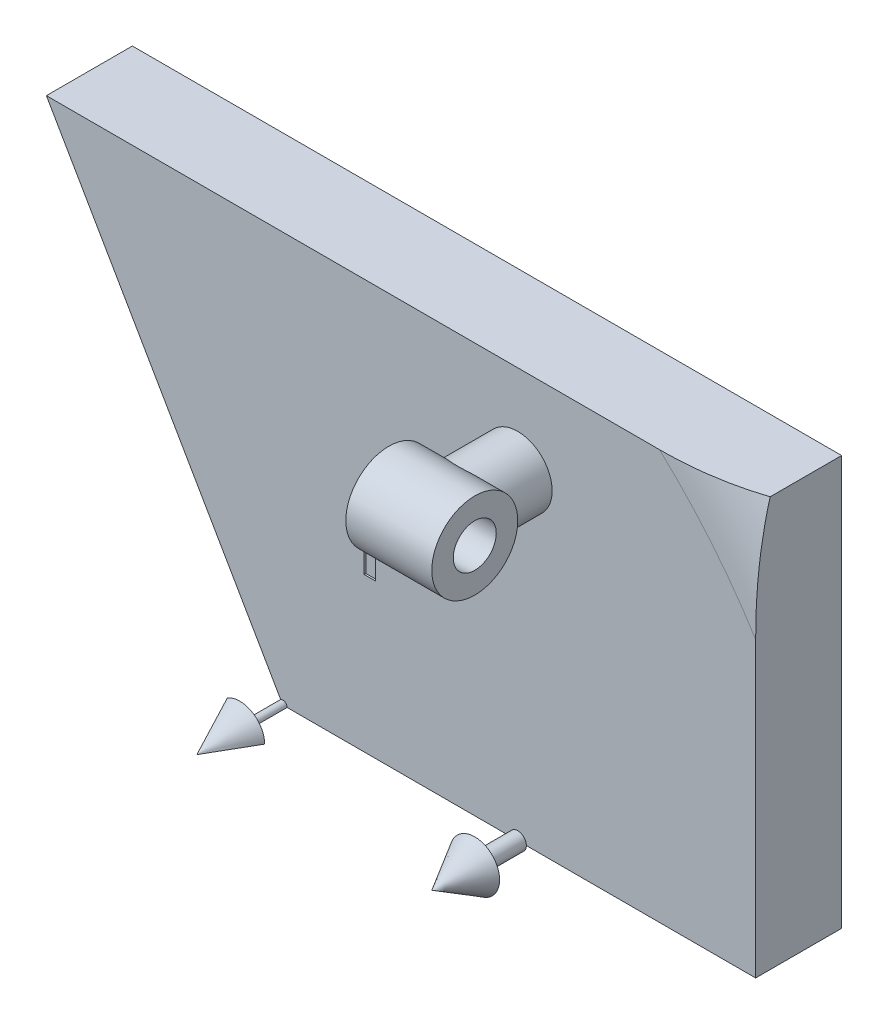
ISO-10303-21;
HEADER;
FILE_DESCRIPTION(('STEP AP214'),'2;1');
FILE_NAME('part.step','',(''),(''),'','','');
FILE_SCHEMA(('AUTOMOTIVE_DESIGN { 1 0 10303 214 1 1 1 1 }'));
ENDSEC;
DATA;
#1=APPLICATION_CONTEXT('core data for automotive mechanical design processes');
#2=APPLICATION_PROTOCOL_DEFINITION('international standard','automotive_design',2000,#1);
#3=PRODUCT_CONTEXT('',#1,'mechanical');
#4=PRODUCT('Part','Part','',(#3));
#5=PRODUCT_RELATED_PRODUCT_CATEGORY('part','',(#4));
#6=PRODUCT_DEFINITION_FORMATION('','',#4);
#7=PRODUCT_DEFINITION_CONTEXT('part definition',#1,'design');
#8=PRODUCT_DEFINITION('design','',#6,#7);
#9=PRODUCT_DEFINITION_SHAPE('','',#8);
#10=(LENGTH_UNIT() NAMED_UNIT(*) SI_UNIT(.MILLI.,.METRE.));
#11=(NAMED_UNIT(*) PLANE_ANGLE_UNIT() SI_UNIT($,.RADIAN.));
#12=(NAMED_UNIT(*) SI_UNIT($,.STERADIAN.) SOLID_ANGLE_UNIT());
#13=UNCERTAINTY_MEASURE_WITH_UNIT(LENGTH_MEASURE(1.E-05),#10,'distance_accuracy_value','');
#14=(GEOMETRIC_REPRESENTATION_CONTEXT(3) GLOBAL_UNCERTAINTY_ASSIGNED_CONTEXT((#13)) GLOBAL_UNIT_ASSIGNED_CONTEXT((#10,
#11,#12)) REPRESENTATION_CONTEXT('',''));
#15=CARTESIAN_POINT('',(0.,0.,0.));
#16=DIRECTION('',(0.,0.,1.));
#17=DIRECTION('',(1.,0.,0.));
#18=AXIS2_PLACEMENT_3D('',#15,#16,#17);
#19=CARTESIAN_POINT('',(55.,0.,10.));
#20=DIRECTION('',(0.,0.,-1.));
#21=DIRECTION('',(-1.,0.,0.));
#22=AXIS2_PLACEMENT_3D('',#19,#20,#21);
#23=PLANE('',#22);
#24=CARTESIAN_POINT('',(27.33,37.23,9.99999999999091));
#25=DIRECTION('',(0.,0.,-1.));
#26=DIRECTION('',(-1.,0.,0.));
#27=AXIS2_PLACEMENT_3D('',#24,#25,#26);
#28=CIRCLE('',#27,4.00000000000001);
#29=CARTESIAN_POINT('',(23.33,37.23,9.99999999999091));
#30=VERTEX_POINT('',#29);
#31=EDGE_CURVE('E51',#30,#30,#28,.F.);
#32=ORIENTED_EDGE('',*,*,#31,.F.);
#33=EDGE_LOOP('',(#32));
#34=FACE_BOUND('',#33,.T.);
#35=DIRECTION('',(0.,1.,0.));
#36=VECTOR('',#35,1.);
#37=CARTESIAN_POINT('',(55.,47.631397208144,10.));
#38=LINE('',#37,#36);
#39=CARTESIAN_POINT('',(55.,0.,10.));
#40=VERTEX_POINT('',#39);
#41=CARTESIAN_POINT('',(55.,34.104626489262,10.));
#42=VERTEX_POINT('',#41);
#43=EDGE_CURVE('E163',#40,#42,#38,.T.);
#44=ORIENTED_EDGE('',*,*,#43,.T.);
#45=CARTESIAN_POINT('',(0.,0.,10.));
#46=DIRECTION('',(0.,0.,-1.));
#47=DIRECTION('',(-1.,0.,0.));
#48=AXIS2_PLACEMENT_3D('',#45,#46,#47);
#49=CIRCLE('',#48,64.715728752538);
#50=CARTESIAN_POINT('',(43.8106784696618,47.631397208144,10.));
#51=VERTEX_POINT('',#50);
#52=EDGE_CURVE('E153',#51,#42,#49,.T.);
#53=ORIENTED_EDGE('',*,*,#52,.F.);
#54=DIRECTION('',(-1.,0.,0.));
#55=VECTOR('',#54,1.);
#56=CARTESIAN_POINT('',(-27.5000000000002,47.631397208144,10.));
#57=LINE('',#56,#55);
#58=CARTESIAN_POINT('',(-27.5000000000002,47.631397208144,10.));
#59=VERTEX_POINT('',#58);
#60=EDGE_CURVE('E160',#51,#59,#57,.T.);
#61=ORIENTED_EDGE('',*,*,#60,.T.);
#62=DIRECTION('',(0.500000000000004,-0.866025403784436,0.));
#63=VECTOR('',#62,1.);
#64=CARTESIAN_POINT('',(-27.5000000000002,47.631397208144,10.));
#65=LINE('',#64,#63);
#66=CARTESIAN_POINT('',(-0.25,0.433012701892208,10.));
#67=VERTEX_POINT('',#66);
#68=EDGE_CURVE('E169',#59,#67,#65,.T.);
#69=ORIENTED_EDGE('',*,*,#68,.T.);
#70=CARTESIAN_POINT('',(0.,0.,10.));
#71=DIRECTION('',(0.,0.,-1.));
#72=DIRECTION('',(-1.,0.,0.));
#73=AXIS2_PLACEMENT_3D('',#70,#71,#72);
#74=CIRCLE('',#73,0.5);
#75=CARTESIAN_POINT('',(0.5,0.,10.));
#76=VERTEX_POINT('',#75);
#77=EDGE_CURVE('E331',#67,#76,#74,.T.);
#78=ORIENTED_EDGE('',*,*,#77,.T.);
#79=DIRECTION('',(1.,0.,0.));
#80=VECTOR('',#79,1.);
#81=CARTESIAN_POINT('',(0.,0.,10.));
#82=LINE('',#81,#80);
#83=CARTESIAN_POINT('',(26.33,0.,10.));
#84=VERTEX_POINT('',#83);
#85=EDGE_CURVE('E173',#76,#84,#82,.T.);
#86=ORIENTED_EDGE('',*,*,#85,.T.);
#87=CARTESIAN_POINT('',(27.33,0.,10.));
#88=DIRECTION('',(0.,0.,-1.));
#89=DIRECTION('',(0.,1.,0.));
#90=AXIS2_PLACEMENT_3D('',#87,#88,#89);
#91=CIRCLE('',#90,1.);
#92=CARTESIAN_POINT('',(28.33,0.,10.));
#93=VERTEX_POINT('',#92);
#94=EDGE_CURVE('E320',#84,#93,#91,.T.);
#95=ORIENTED_EDGE('',*,*,#94,.T.);
#96=EDGE_CURVE('E188',#93,#40,#82,.T.);
#97=ORIENTED_EDGE('',*,*,#96,.T.);
#98=EDGE_LOOP('',(#44,#53,#61,#69,#78,#86,#95,#97));
#99=FACE_BOUND('',#98,.T.);
#100=DIRECTION('',(0.540859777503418,0.841112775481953,0.));
#101=VECTOR('',#100,1.);
#102=CARTESIAN_POINT('',(7.94435931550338,24.0520440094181,10.));
#103=LINE('',#102,#101);
#104=CARTESIAN_POINT('',(7.94435931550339,24.0520440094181,10.));
#105=VERTEX_POINT('',#104);
#106=CARTESIAN_POINT('',(8.73832132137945,25.2867662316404,10.));
#107=VERTEX_POINT('',#106);
#108=EDGE_CURVE('E65',#105,#107,#103,.T.);
#109=ORIENTED_EDGE('',*,*,#108,.T.);
#110=DIRECTION('',(1.,0.,0.));
#111=VECTOR('',#110,1.);
#112=CARTESIAN_POINT('',(8.73832132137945,25.2867662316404,10.));
#113=LINE('',#112,#111);
#114=CARTESIAN_POINT('',(10.7937182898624,25.2867662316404,10.));
#115=VERTEX_POINT('',#114);
#116=EDGE_CURVE('E570',#107,#115,#113,.T.);
#117=ORIENTED_EDGE('',*,*,#116,.T.);
#118=DIRECTION('',(0.,-1.,0.));
#119=VECTOR('',#118,1.);
#120=CARTESIAN_POINT('',(10.7937182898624,25.2867662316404,10.));
#121=LINE('',#120,#119);
#122=CARTESIAN_POINT('',(10.7937182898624,17.878432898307,10.));
#123=VERTEX_POINT('',#122);
#124=EDGE_CURVE('E567',#115,#123,#121,.T.);
#125=ORIENTED_EDGE('',*,*,#124,.T.);
#126=DIRECTION('',(-1.,0.,0.));
#127=VECTOR('',#126,1.);
#128=CARTESIAN_POINT('',(10.7937182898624,17.878432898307,10.));
#129=LINE('',#128,#127);
#130=CARTESIAN_POINT('',(9.4640174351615,17.878432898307,10.));
#131=VERTEX_POINT('',#130);
#132=EDGE_CURVE('E564',#123,#131,#129,.T.);
#133=ORIENTED_EDGE('',*,*,#132,.T.);
#134=DIRECTION('',(0.,1.,0.));
#135=VECTOR('',#134,1.);
#136=CARTESIAN_POINT('',(9.4640174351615,17.878432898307,10.));
#137=LINE('',#136,#135);
#138=CARTESIAN_POINT('',(9.4640174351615,24.0520440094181,10.));
#139=VERTEX_POINT('',#138);
#140=EDGE_CURVE('E561',#131,#139,#137,.T.);
#141=ORIENTED_EDGE('',*,*,#140,.T.);
#142=DIRECTION('',(-1.,0.,0.));
#143=VECTOR('',#142,1.);
#144=CARTESIAN_POINT('',(9.4640174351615,24.0520440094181,10.));
#145=LINE('',#144,#143);
#146=EDGE_CURVE('E558',#139,#105,#145,.T.);
#147=ORIENTED_EDGE('',*,*,#146,.T.);
#148=EDGE_LOOP('',(#109,#117,#125,#133,#141,#147));
#149=FACE_BOUND('',#148,.T.);
#150=ADVANCED_FACE('F39',(#34,#99,#149),#23,.F.);
#151=CARTESIAN_POINT('',(0.,0.,10.));
#152=DIRECTION('',(0.,1.,0.));
#153=DIRECTION('',(0.,0.,1.));
#154=AXIS2_PLACEMENT_3D('',#151,#152,#153);
#155=PLANE('',#154);
#156=DIRECTION('',(1.,0.,0.));
#157=VECTOR('',#156,1.);
#158=CARTESIAN_POINT('',(0.,0.,0.));
#159=LINE('',#158,#157);
#160=CARTESIAN_POINT('',(0.,0.,0.));
#161=VERTEX_POINT('',#160);
#162=CARTESIAN_POINT('',(55.,0.,0.));
#163=VERTEX_POINT('',#162);
#164=EDGE_CURVE('E177',#161,#163,#159,.T.);
#165=ORIENTED_EDGE('',*,*,#164,.T.);
#166=DIRECTION('',(0.,0.,-1.));
#167=VECTOR('',#166,1.);
#168=CARTESIAN_POINT('',(55.,0.,10.));
#169=LINE('',#168,#167);
#170=EDGE_CURVE('E194',#40,#163,#169,.T.);
#171=ORIENTED_EDGE('',*,*,#170,.F.);
#172=ORIENTED_EDGE('',*,*,#96,.F.);
#173=EDGE_CURVE('E315',#84,#93,#82,.T.);
#174=ORIENTED_EDGE('',*,*,#173,.F.);
#175=ORIENTED_EDGE('',*,*,#85,.F.);
#176=DIRECTION('',(0.,0.,1.));
#177=VECTOR('',#176,1.);
#178=CARTESIAN_POINT('',(0.5,0.,10.));
#179=LINE('',#178,#177);
#180=CARTESIAN_POINT('',(0.5,0.,15.));
#181=VERTEX_POINT('',#180);
#182=EDGE_CURVE('E334',#76,#181,#179,.T.);
#183=ORIENTED_EDGE('',*,*,#182,.T.);
#184=DIRECTION('',(1.,0.,0.));
#185=VECTOR('',#184,1.);
#186=CARTESIAN_POINT('',(0.5,0.,15.));
#187=LINE('',#186,#185);
#188=CARTESIAN_POINT('',(2.88675134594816,0.,15.));
#189=VERTEX_POINT('',#188);
#190=EDGE_CURVE('E527',#181,#189,#187,.T.);
#191=ORIENTED_EDGE('',*,*,#190,.T.);
#192=DIRECTION('',(-0.500000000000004,0.,0.866025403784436));
#193=VECTOR('',#192,1.);
#194=CARTESIAN_POINT('',(2.88675134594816,0.,15.));
#195=LINE('',#194,#193);
#196=CARTESIAN_POINT('',(0.,0.,20.));
#197=VERTEX_POINT('',#196);
#198=EDGE_CURVE('E530',#189,#197,#195,.T.);
#199=ORIENTED_EDGE('',*,*,#198,.T.);
#200=DIRECTION('',(0.,0.,-1.));
#201=VECTOR('',#200,1.);
#202=CARTESIAN_POINT('',(0.,0.,10.));
#203=LINE('',#202,#201);
#204=EDGE_CURVE('E171',#197,#161,#203,.T.);
#205=ORIENTED_EDGE('',*,*,#204,.T.);
#206=EDGE_LOOP('',(#165,#171,#172,#174,#175,#183,#191,#199,#205));
#207=FACE_BOUND('',#206,.T.);
#208=ADVANCED_FACE('F41',(#207),#155,.F.);
#209=CARTESIAN_POINT('',(55.,47.631397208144,10.));
#210=DIRECTION('',(-1.,0.,0.));
#211=DIRECTION('',(0.,-1.,0.));
#212=AXIS2_PLACEMENT_3D('',#209,#210,#211);
#213=PLANE('',#212);
#214=DIRECTION('',(0.,0.,-1.));
#215=VECTOR('',#214,1.);
#216=CARTESIAN_POINT('',(55.,47.631397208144,10.));
#217=LINE('',#216,#215);
#218=CARTESIAN_POINT('',(55.,47.631397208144,8.31172527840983));
#219=VERTEX_POINT('',#218);
#220=CARTESIAN_POINT('',(55.,47.631397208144,0.));
#221=VERTEX_POINT('',#220);
#222=EDGE_CURVE('E192',#219,#221,#217,.T.);
#223=ORIENTED_EDGE('',*,*,#222,.F.);
#224=CARTESIAN_POINT('',(54.9999999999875,23.5563264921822,9.39463403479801));
#225=CARTESIAN_POINT('',(54.9999999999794,21.8487438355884,9.22535587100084));
#226=CARTESIAN_POINT('',(54.9999999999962,20.1433436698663,9.03467150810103));
#227=CARTESIAN_POINT('',(55.0000000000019,17.5855516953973,8.74525509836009));
#228=CARTESIAN_POINT('',(55.0000000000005,16.732923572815,8.64820846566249));
#229=CARTESIAN_POINT('',(54.9999999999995,15.0272658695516,8.45772977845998));
#230=CARTESIAN_POINT('',(54.9999999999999,14.1742362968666,8.36429765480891));
#231=CARTESIAN_POINT('',(55.0000000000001,12.4690306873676,8.18583024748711));
#232=CARTESIAN_POINT('',(55.,11.6168564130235,8.10077836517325));
#233=CARTESIAN_POINT('',(55.,9.91133671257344,7.94314996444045));
#234=CARTESIAN_POINT('',(55.,9.0579912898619,7.87057340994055));
#235=CARTESIAN_POINT('',(55.,7.35026571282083,7.74171582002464));
#236=CARTESIAN_POINT('',(55.,6.49588587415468,7.68543067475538));
#237=CARTESIAN_POINT('',(55.,4.78605820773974,7.59219713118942));
#238=CARTESIAN_POINT('',(55.,3.93061038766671,7.55524859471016));
#239=CARTESIAN_POINT('',(55.,2.22081761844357,7.50281946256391));
#240=CARTESIAN_POINT('',(55.,1.36647405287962,7.48729457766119));
#241=CARTESIAN_POINT('',(55.,-0.342329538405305,7.4784560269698));
#242=CARTESIAN_POINT('',(55.,-1.19678956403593,7.48514234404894));
#243=CARTESIAN_POINT('',(55.,-2.90535751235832,7.52034538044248));
#244=CARTESIAN_POINT('',(55.,-3.75946537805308,7.54886481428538));
#245=CARTESIAN_POINT('',(55.,-5.46675395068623,7.62612469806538));
#246=CARTESIAN_POINT('',(55.,-6.31993465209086,7.67486526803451));
#247=CARTESIAN_POINT('',(55.,-8.02693072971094,7.79001009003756));
#248=CARTESIAN_POINT('',(55.,-8.88074350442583,7.85645222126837));
#249=CARTESIAN_POINT('',(55.,-10.5871401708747,8.00341417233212));
#250=CARTESIAN_POINT('',(55.,-11.4397240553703,8.08393407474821));
#251=CARTESIAN_POINT('',(55.,-13.1439113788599,8.25493171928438));
#252=CARTESIAN_POINT('',(55.,-13.9955147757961,8.34540987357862));
#253=CARTESIAN_POINT('',(55.,-15.6981240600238,8.53184066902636));
#254=CARTESIAN_POINT('',(55.,-16.5491299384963,8.62779338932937));
#255=CARTESIAN_POINT('',(55.,-18.1156761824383,8.80517336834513));
#256=CARTESIAN_POINT('',(55.,-18.8312297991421,8.88648303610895));
#257=CARTESIAN_POINT('',(55.,-20.2625517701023,9.04684479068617));
#258=CARTESIAN_POINT('',(55.,-20.9783201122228,9.12589698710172));
#259=CARTESIAN_POINT('',(55.,-23.1255591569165,9.3553278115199));
#260=CARTESIAN_POINT('',(55.,-24.5578876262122,9.49809267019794));
#261=CARTESIAN_POINT('',(55.,-27.428704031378,9.74088084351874));
#262=CARTESIAN_POINT('',(55.,-28.8671981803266,9.84083471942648));
#263=CARTESIAN_POINT('',(55.,-31.7477063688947,9.97478416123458));
#264=CARTESIAN_POINT('',(55.,-33.1897205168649,10.0087776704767));
#265=CARTESIAN_POINT('',(55.,-35.8395998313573,9.98906303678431));
#266=CARTESIAN_POINT('',(55.,-37.0475219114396,9.94868062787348));
#267=CARTESIAN_POINT('',(55.,-39.4582060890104,9.79079948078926));
#268=CARTESIAN_POINT('',(55.,-40.6609699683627,9.67332997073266));
#269=CARTESIAN_POINT('',(55.,-43.0526425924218,9.34663792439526));
#270=CARTESIAN_POINT('',(55.,-44.2415680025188,9.13754079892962));
#271=CARTESIAN_POINT('',(55.,-46.5954725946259,8.61232986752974));
#272=CARTESIAN_POINT('',(55.,-47.7604687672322,8.29629498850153));
#273=CARTESIAN_POINT('',(55.,-49.5576517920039,7.7043203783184));
#274=CARTESIAN_POINT('',(55.,-50.2035218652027,7.46958297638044));
#275=CARTESIAN_POINT('',(55.,-51.4783096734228,6.95769376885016));
#276=CARTESIAN_POINT('',(55.,-52.1072284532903,6.68054458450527));
#277=CARTESIAN_POINT('',(55.,-53.3429656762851,6.08151417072));
#278=CARTESIAN_POINT('',(55.,-53.949801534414,5.75966919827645));
#279=CARTESIAN_POINT('',(55.,-54.8394134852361,5.24179437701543));
#280=CARTESIAN_POINT('',(55.,-55.1324999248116,5.06332553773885));
#281=CARTESIAN_POINT('',(55.,-55.711139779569,4.69439988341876));
#282=CARTESIAN_POINT('',(55.,-55.9966912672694,4.50394004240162));
#283=CARTESIAN_POINT('',(55.,-56.7458028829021,3.98063683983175));
#284=CARTESIAN_POINT('',(55.,-57.2019507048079,3.63706538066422));
#285=CARTESIAN_POINT('',(55.,-58.0865212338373,2.91602901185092));
#286=CARTESIAN_POINT('',(55.,-58.5149495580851,2.5385710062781));
#287=CARTESIAN_POINT('',(55.,-59.3392697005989,1.75003517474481));
#288=CARTESIAN_POINT('',(55.,-59.7351816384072,1.33897845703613));
#289=CARTESIAN_POINT('',(55.,-60.4896649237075,0.483889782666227));
#290=CARTESIAN_POINT('',(55.,-60.8482429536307,0.0398637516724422));
#291=CARTESIAN_POINT('',(55.,-61.4640638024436,-0.799406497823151));
#292=CARTESIAN_POINT('',(55.,-61.7280810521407,-1.18968826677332));
#293=CARTESIAN_POINT('',(55.,-62.2240503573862,-1.99008675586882));
#294=CARTESIAN_POINT('',(55.,-62.4560086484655,-2.40019959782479));
#295=CARTESIAN_POINT('',(55.,-62.8849347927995,-3.23824351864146));
#296=CARTESIAN_POINT('',(55.,-63.0819113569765,-3.66617012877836));
#297=CARTESIAN_POINT('',(55.,-63.438245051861,-4.53745890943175));
#298=CARTESIAN_POINT('',(55.,-63.5976015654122,-4.98082133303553));
#299=CARTESIAN_POINT('',(55.,-63.8770183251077,-5.88220935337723));
#300=CARTESIAN_POINT('',(55.,-63.9968796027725,-6.34029680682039));
#301=CARTESIAN_POINT('',(55.,-64.1943072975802,-7.26552590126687));
#302=CARTESIAN_POINT('',(55.,-64.2718733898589,-7.73266761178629));
#303=CARTESIAN_POINT('',(55.,-64.383407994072,-8.67203247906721));
#304=CARTESIAN_POINT('',(55.,-64.4173862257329,-9.14425447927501));
#305=CARTESIAN_POINT('',(55.,-64.4411934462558,-10.0897932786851));
#306=CARTESIAN_POINT('',(55.,-64.4310255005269,-10.5631099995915));
#307=CARTESIAN_POINT('',(55.,-64.3694555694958,-11.4667594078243));
#308=CARTESIAN_POINT('',(55.,-64.3216164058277,-11.8973395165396));
#309=CARTESIAN_POINT('',(55.,-64.1897957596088,-12.7528991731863));
#310=CARTESIAN_POINT('',(55.,-64.1058167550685,-13.1778791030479));
#311=CARTESIAN_POINT('',(55.,-63.9028777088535,-14.0193451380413));
#312=CARTESIAN_POINT('',(55.,-63.7839204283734,-14.4358319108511));
#313=CARTESIAN_POINT('',(55.,-63.51258217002,-15.25776265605));
#314=CARTESIAN_POINT('',(55.,-63.3601999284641,-15.6632062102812));
#315=CARTESIAN_POINT('',(55.,-63.02134082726,-16.466838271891));
#316=CARTESIAN_POINT('',(55.,-62.8343805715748,-16.8648225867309));
#317=CARTESIAN_POINT('',(55.,-62.4301863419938,-17.6450582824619));
#318=CARTESIAN_POINT('',(55.,-62.2129529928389,-18.0273099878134));
#319=CARTESIAN_POINT('',(55.,-61.7505361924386,-18.7745734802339));
#320=CARTESIAN_POINT('',(55.,-61.5053480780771,-19.1395823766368));
#321=CARTESIAN_POINT('',(55.,-60.9894634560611,-19.851135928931));
#322=CARTESIAN_POINT('',(55.,-60.718762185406,-20.197677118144));
#323=CARTESIAN_POINT('',(55.,-60.049275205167,-20.9967301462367));
#324=CARTESIAN_POINT('',(55.,-59.6402904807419,-21.44073285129));
#325=CARTESIAN_POINT('',(55.,-58.7849044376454,-22.2911043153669));
#326=CARTESIAN_POINT('',(55.,-58.3384924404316,-22.6974622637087));
#327=CARTESIAN_POINT('',(55.,-57.4131139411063,-23.4728837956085));
#328=CARTESIAN_POINT('',(55.,-56.9340910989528,-23.8418799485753));
#329=CARTESIAN_POINT('',(55.,-55.949363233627,-24.5421766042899));
#330=CARTESIAN_POINT('',(55.,-55.443657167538,-24.8734756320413));
#331=CARTESIAN_POINT('',(55.,-54.2127281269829,-25.6188761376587));
#332=CARTESIAN_POINT('',(55.,-53.4773890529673,-26.016320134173));
#333=CARTESIAN_POINT('',(55.,-51.9745654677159,-26.7448852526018));
#334=CARTESIAN_POINT('',(55.,-51.207068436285,-27.0759802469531));
#335=CARTESIAN_POINT('',(55.,-49.6486079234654,-27.6762268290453));
#336=CARTESIAN_POINT('',(55.,-48.8576505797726,-27.9453944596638));
#337=CARTESIAN_POINT('',(55.,-47.2588755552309,-28.426815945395));
#338=CARTESIAN_POINT('',(55.,-46.4510589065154,-28.6390732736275));
#339=CARTESIAN_POINT('',(55.,-44.2710719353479,-29.1384265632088));
#340=CARTESIAN_POINT('',(55.,-42.8880666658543,-29.3785088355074));
#341=CARTESIAN_POINT('',(55.,-40.1062248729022,-29.7369014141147));
#342=CARTESIAN_POINT('',(55.,-38.7073758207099,-29.8551073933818));
#343=CARTESIAN_POINT('',(55.,-35.8979266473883,-29.9930623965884));
#344=CARTESIAN_POINT('',(55.,-34.4873033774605,-30.0122916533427));
#345=CARTESIAN_POINT('',(55.,-31.6681762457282,-29.9733824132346));
#346=CARTESIAN_POINT('',(55.,-30.2596717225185,-29.91527812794));
#347=CARTESIAN_POINT('',(55.,-27.2308291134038,-29.7302844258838));
#348=CARTESIAN_POINT('',(55.,-25.6110957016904,-29.5942209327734));
#349=CARTESIAN_POINT('',(55.,-22.3754967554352,-29.2807157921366));
#350=CARTESIAN_POINT('',(55.,-20.7596324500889,-29.1032624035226));
#351=CARTESIAN_POINT('',(55.,-17.5282447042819,-28.7395517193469));
#352=CARTESIAN_POINT('',(55.,-15.9127216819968,-28.5532908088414));
#353=CARTESIAN_POINT('',(55.,-13.4875736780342,-28.2914277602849));
#354=CARTESIAN_POINT('',(55.,-12.6789206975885,-28.2070652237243));
#355=CARTESIAN_POINT('',(55.,-11.0606602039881,-28.0479462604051));
#356=CARTESIAN_POINT('',(55.,-10.251052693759,-27.9731898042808));
#357=CARTESIAN_POINT('',(55.,-8.63234310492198,-27.8368954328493));
#358=CARTESIAN_POINT('',(55.,-7.82324326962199,-27.7753313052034));
#359=CARTESIAN_POINT('',(55.,-6.20397286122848,-27.6681856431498));
#360=CARTESIAN_POINT('',(55.,-5.3938022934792,-27.6226040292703));
#361=CARTESIAN_POINT('',(55.,-3.77272883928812,-27.5496925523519));
#362=CARTESIAN_POINT('',(55.,-2.96182605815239,-27.5223603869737));
#363=CARTESIAN_POINT('',(55.,-1.33959122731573,-27.4873318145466));
#364=CARTESIAN_POINT('',(55.,-0.528259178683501,-27.4796353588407));
#365=CARTESIAN_POINT('',(55.,1.09386169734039,-27.4842741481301));
#366=CARTESIAN_POINT('',(55.,1.90465055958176,-27.4965974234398));
#367=CARTESIAN_POINT('',(55.,3.52569517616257,-27.5406185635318));
#368=CARTESIAN_POINT('',(55.,4.33595092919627,-27.5723164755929));
#369=CARTESIAN_POINT('',(55.,5.95568150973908,-27.6534870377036));
#370=CARTESIAN_POINT('',(55.,6.76515619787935,-27.7029624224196));
#371=CARTESIAN_POINT('',(55.,8.38301111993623,-27.8172517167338));
#372=CARTESIAN_POINT('',(55.,9.19139134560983,-27.8820657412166));
#373=CARTESIAN_POINT('',(55.,10.6731085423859,-28.0121843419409));
#374=CARTESIAN_POINT('',(55.,11.3466121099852,-28.0756256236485));
#375=CARTESIAN_POINT('',(55.,12.6929753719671,-28.2089955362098));
#376=CARTESIAN_POINT('',(55.,13.3658350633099,-28.2789241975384));
#377=CARTESIAN_POINT('',(55.,15.3836519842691,-28.4951891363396));
#378=CARTESIAN_POINT('',(55.,16.7279005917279,-28.6480094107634));
#379=CARTESIAN_POINT('',(55.,19.4191239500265,-28.9528707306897));
#380=CARTESIAN_POINT('',(55.,20.7660989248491,-29.1049096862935));
#381=CARTESIAN_POINT('',(55.,23.4621339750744,-29.3889925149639));
#382=CARTESIAN_POINT('',(55.,24.8111938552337,-29.5210381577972));
#383=CARTESIAN_POINT('',(55.,27.5041898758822,-29.7455479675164));
#384=CARTESIAN_POINT('',(55.,28.848104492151,-29.8382570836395));
#385=CARTESIAN_POINT('',(55.,31.5392036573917,-29.9666412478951));
#386=CARTESIAN_POINT('',(55.,32.8863888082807,-30.0023048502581));
#387=CARTESIAN_POINT('',(55.,35.5769251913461,-29.9974705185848));
#388=CARTESIAN_POINT('',(55.,36.9202758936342,-29.9571990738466));
#389=CARTESIAN_POINT('',(55.,39.6004228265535,-29.7812996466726));
#390=CARTESIAN_POINT('',(55.,40.9372230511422,-29.6457397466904));
#391=CARTESIAN_POINT('',(55.,43.1311830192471,-29.3262739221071));
#392=CARTESIAN_POINT('',(55.,43.9931929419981,-29.1756639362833));
#393=CARTESIAN_POINT('',(55.,45.7062098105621,-28.8193723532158));
#394=CARTESIAN_POINT('',(55.,46.557212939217,-28.6136721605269));
#395=CARTESIAN_POINT('',(55.,48.2436865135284,-28.1409189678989));
#396=CARTESIAN_POINT('',(55.,49.0791317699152,-27.8737744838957));
#397=CARTESIAN_POINT('',(55.,50.3137066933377,-27.4230021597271));
#398=CARTESIAN_POINT('',(55.,50.7220795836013,-27.264426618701));
#399=CARTESIAN_POINT('',(55.,51.5317450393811,-26.9298357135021));
#400=CARTESIAN_POINT('',(55.,51.9330359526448,-26.7538163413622));
#401=CARTESIAN_POINT('',(55.,52.9179842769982,-26.2948117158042));
#402=CARTESIAN_POINT('',(55.,53.4966772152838,-26.0010508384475));
#403=CARTESIAN_POINT('',(55.,54.6310002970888,-25.3721240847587));
#404=CARTESIAN_POINT('',(55.,55.1866361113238,-25.0369684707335));
#405=CARTESIAN_POINT('',(55.,56.2689129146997,-24.3242652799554));
#406=CARTESIAN_POINT('',(55.,56.7955974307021,-23.9467840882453));
#407=CARTESIAN_POINT('',(55.,57.8148131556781,-23.1481876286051));
#408=CARTESIAN_POINT('',(55.,58.3073518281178,-22.7270819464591));
#409=CARTESIAN_POINT('',(55.,59.155009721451,-21.9318510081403));
#410=CARTESIAN_POINT('',(55.,59.5176388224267,-21.565717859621));
#411=CARTESIAN_POINT('',(55.,60.2133249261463,-20.8064067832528));
#412=CARTESIAN_POINT('',(55.,60.5463886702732,-20.4132350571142));
#413=CARTESIAN_POINT('',(55.,61.1791971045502,-19.6007904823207));
#414=CARTESIAN_POINT('',(55.,61.4789378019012,-19.1815145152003));
#415=CARTESIAN_POINT('',(55.,62.0411333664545,-18.3185859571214));
#416=CARTESIAN_POINT('',(55.,62.3035876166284,-17.8749329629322));
#417=CARTESIAN_POINT('',(55.,62.7892710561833,-16.9620448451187));
#418=CARTESIAN_POINT('',(55.,63.0121716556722,-16.4926343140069));
#419=CARTESIAN_POINT('',(55.,63.4124838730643,-15.5347298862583));
#420=CARTESIAN_POINT('',(55.,63.589894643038,-15.046235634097));
#421=CARTESIAN_POINT('',(55.,63.8959263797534,-14.0545133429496));
#422=CARTESIAN_POINT('',(55.,64.024579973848,-13.5512954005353));
#423=CARTESIAN_POINT('',(55.,64.2307750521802,-12.5345114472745));
#424=CARTESIAN_POINT('',(55.,64.3083242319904,-12.0209470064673));
#425=CARTESIAN_POINT('',(55.,64.4040188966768,-11.0568824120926));
#426=CARTESIAN_POINT('',(55.,64.4286599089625,-10.6070162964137));
#427=CARTESIAN_POINT('',(55.,64.4379431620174,-9.70689677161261));
#428=CARTESIAN_POINT('',(55.,64.4225895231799,-9.25664340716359));
#429=CARTESIAN_POINT('',(55.,64.3521329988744,-8.35938797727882));
#430=CARTESIAN_POINT('',(55.,64.2970402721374,-7.91238511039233));
#431=CARTESIAN_POINT('',(55.,64.1479562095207,-7.02492214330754));
#432=CARTESIAN_POINT('',(55.,64.0539647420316,-6.58446206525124));
#433=CARTESIAN_POINT('',(55.,63.8334725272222,-5.73258587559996));
#434=CARTESIAN_POINT('',(55.,63.7085959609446,-5.32074740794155));
#435=CARTESIAN_POINT('',(55.,63.426196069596,-4.50846162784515));
#436=CARTESIAN_POINT('',(55.,63.2686742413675,-4.10801379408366));
#437=CARTESIAN_POINT('',(55.,62.9228674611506,-3.32061821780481));
#438=CARTESIAN_POINT('',(55.,62.734579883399,-2.93367163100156));
#439=CARTESIAN_POINT('',(55.,62.3293577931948,-2.17509370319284));
#440=CARTESIAN_POINT('',(55.,62.1124216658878,-1.80346322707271));
#441=CARTESIAN_POINT('',(55.,61.6343403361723,-1.04886955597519));
#442=CARTESIAN_POINT('',(55.,61.3710740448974,-0.667250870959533));
#443=CARTESIAN_POINT('',(55.,60.8167548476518,0.0751887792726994));
#444=CARTESIAN_POINT('',(55.,60.5257013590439,0.436009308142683));
#445=CARTESIAN_POINT('',(55.,59.9185703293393,1.13603316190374));
#446=CARTESIAN_POINT('',(55.,59.6024877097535,1.47523207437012));
#447=CARTESIAN_POINT('',(55.,58.9480510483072,2.13146080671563));
#448=CARTESIAN_POINT('',(55.,58.6096923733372,2.44848598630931));
#449=CARTESIAN_POINT('',(55.,57.7429996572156,3.20970512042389));
#450=CARTESIAN_POINT('',(55.,57.2026591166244,3.6402995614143));
#451=CARTESIAN_POINT('',(55.,56.0861483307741,4.45225432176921));
#452=CARTESIAN_POINT('',(55.,55.5099644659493,4.83359575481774));
#453=CARTESIAN_POINT('',(55.,54.3274300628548,5.5491401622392));
#454=CARTESIAN_POINT('',(55.,53.7210166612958,5.88323884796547));
#455=CARTESIAN_POINT('',(55.,52.4851668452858,6.50535940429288));
#456=CARTESIAN_POINT('',(55.,51.8557302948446,6.79338100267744));
#457=CARTESIAN_POINT('',(55.,50.2724227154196,7.45362640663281));
#458=CARTESIAN_POINT('',(55.,49.3077324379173,7.79998469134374));
#459=CARTESIAN_POINT('',(55.,47.3514089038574,8.4064380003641));
#460=CARTESIAN_POINT('',(55.,46.3597598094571,8.66648107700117));
#461=CARTESIAN_POINT('',(55.,44.8598570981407,8.99873538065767));
#462=CARTESIAN_POINT('',(55.,44.3577803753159,9.09985711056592));
#463=CARTESIAN_POINT('',(55.,43.3505352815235,9.28398623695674));
#464=CARTESIAN_POINT('',(55.,42.8453683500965,9.36700149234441));
#465=CARTESIAN_POINT('',(55.,41.3261421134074,9.59070961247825));
#466=CARTESIAN_POINT('',(55.,40.3083119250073,9.70607465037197));
#467=CARTESIAN_POINT('',(55.,37.9809879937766,9.90261113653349));
#468=CARTESIAN_POINT('',(54.9999999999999,36.6699705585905,9.96504194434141));
#469=CARTESIAN_POINT('',(55.0000000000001,34.0467818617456,10.0125471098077));
#470=CARTESIAN_POINT('',(55.0000000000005,32.7346104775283,9.99761190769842));
#471=CARTESIAN_POINT('',(54.9999999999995,30.1098070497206,9.90807890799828));
#472=CARTESIAN_POINT('',(54.9999999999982,28.7971797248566,9.83335707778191));
#473=CARTESIAN_POINT('',(55.0000000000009,26.8304628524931,9.68947744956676));
#474=CARTESIAN_POINT('',(55.0000000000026,26.1751167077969,9.63620280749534));
#475=CARTESIAN_POINT('',(54.9999999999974,24.8651824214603,9.52121078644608));
#476=CARTESIAN_POINT('',(54.9999999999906,24.2105942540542,9.45949370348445));
#477=CARTESIAN_POINT('',(54.9999999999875,23.5563264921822,9.39463403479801));
#478=B_SPLINE_CURVE_WITH_KNOTS('',3,(#224,#225,#226,#227,#228,#229,#230,#231,#232,#233,#234,
#235,#236,#237,#238,#239,#240,#241,#242,#243,#244,#245,#246,#247,#248,#249,#250,#251,#252,#253,
#254,#255,#256,#257,#258,#259,#260,#261,#262,#263,#264,#265,#266,#267,#268,#269,#270,#271,#272,
#273,#274,#275,#276,#277,#278,#279,#280,#281,#282,#283,#284,#285,#286,#287,#288,#289,#290,#291,
#292,#293,#294,#295,#296,#297,#298,#299,#300,#301,#302,#303,#304,#305,#306,#307,#308,#309,#310,
#311,#312,#313,#314,#315,#316,#317,#318,#319,#320,#321,#322,#323,#324,#325,#326,#327,#328,#329,
#330,#331,#332,#333,#334,#335,#336,#337,#338,#339,#340,#341,#342,#343,#344,#345,#346,#347,#348,
#349,#350,#351,#352,#353,#354,#355,#356,#357,#358,#359,#360,#361,#362,#363,#364,#365,#366,#367,
#368,#369,#370,#371,#372,#373,#374,#375,#376,#377,#378,#379,#380,#381,#382,#383,#384,#385,#386,
#387,#388,#389,#390,#391,#392,#393,#394,#395,#396,#397,#398,#399,#400,#401,#402,#403,#404,#405,
#406,#407,#408,#409,#410,#411,#412,#413,#414,#415,#416,#417,#418,#419,#420,#421,#422,#423,#424,
#425,#426,#427,#428,#429,#430,#431,#432,#433,#434,#435,#436,#437,#438,#439,#440,#441,#442,#443,
#444,#445,#446,#447,#448,#449,#450,#451,#452,#453,#454,#455,#456,#457,#458,#459,#460,#461,#462,
#463,#464,#465,#466,#467,#468,#469,#470,#471,#472,#473,#474,#475,#476,#477),.UNSPECIFIED.,.T.,
.F.,(4,2,2,2,2,2,2,2,2,2,2,2,2,2,2,2,2,2,2,2,2,2,2,2,2,2,2,2,2,2,2,2,2,2,2,2,2,2,2,2,2,2,2,2,2,
2,2,2,2,2,2,2,2,2,2,2,2,2,2,2,2,2,2,2,2,2,2,2,2,2,2,2,2,2,2,2,2,2,2,2,2,2,2,2,2,2,2,2,2,2,2,2,2,
2,2,2,2,2,2,2,2,2,2,2,2,2,2,2,2,2,2,2,2,2,2,2,2,2,2,2,2,2,2,2,2,2,4),(0.,5.14784526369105,
7.72226428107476,10.2966340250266,12.8657976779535,15.4349539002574,18.0034614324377,
20.571950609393,23.1351219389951,25.6982912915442,28.2617793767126,30.8252826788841,
33.3943162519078,35.963364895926,38.5325199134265,41.1017120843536,43.2621844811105,
45.4225518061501,49.7404950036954,54.0654155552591,58.3904709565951,62.0142925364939,
65.6367409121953,69.2542466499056,72.8690882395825,74.9294169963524,76.9896184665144,
79.0481583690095,80.0773513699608,81.1068051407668,82.8183372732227,84.5295214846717,
86.2396387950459,87.9494494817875,89.3616374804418,90.7735504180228,92.1851112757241,
93.5966952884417,95.0152855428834,96.4338866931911,97.8521714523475,99.2703577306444,
100.568511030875,101.866575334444,103.164537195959,104.462548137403,105.780304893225,
107.098034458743,108.415984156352,109.734180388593,111.542523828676,113.351384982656,
115.163454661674,116.97559521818,119.479372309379,121.984133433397,124.488244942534,
126.992203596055,131.195995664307,135.403383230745,139.632843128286,143.860432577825,
148.735681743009,153.612315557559,158.490968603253,160.930052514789,163.369128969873,
165.803313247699,168.237485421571,170.671350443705,173.105209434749,175.53761377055,
177.970024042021,180.402808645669,182.835611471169,184.865028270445,186.894454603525,
190.953145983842,195.019720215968,199.085934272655,203.12644250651,207.167761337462,
211.197045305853,215.223453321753,217.84712912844,220.471691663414,223.10018748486,
224.414084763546,225.728284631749,227.673578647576,229.618391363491,231.560195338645,
233.501573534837,235.046112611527,236.590298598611,238.134669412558,239.679065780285,
241.235745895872,242.792455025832,244.348120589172,245.903551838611,247.253448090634,
248.603205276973,249.952617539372,251.30203436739,252.591686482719,253.881279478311,
255.170982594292,256.460758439,257.850231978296,259.239734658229,260.629519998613,
262.019595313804,264.089247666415,266.159691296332,268.234636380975,270.309593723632,
273.379692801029,276.451636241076,277.987835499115,279.523366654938,282.594289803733,
286.528852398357,290.46390118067,294.407134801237,296.379623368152,298.352042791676),.UNSPECIFIED.);
#479=EDGE_CURVE('E58',#219,#42,#478,.T.);
#480=ORIENTED_EDGE('',*,*,#479,.T.);
#481=ORIENTED_EDGE('',*,*,#43,.F.);
#482=ORIENTED_EDGE('',*,*,#170,.T.);
#483=DIRECTION('',(0.,1.,0.));
#484=VECTOR('',#483,1.);
#485=CARTESIAN_POINT('',(55.,47.631397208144,0.));
#486=LINE('',#485,#484);
#487=EDGE_CURVE('E180',#163,#221,#486,.T.);
#488=ORIENTED_EDGE('',*,*,#487,.T.);
#489=EDGE_LOOP('',(#223,#480,#481,#482,#488));
#490=FACE_BOUND('',#489,.T.);
#491=ADVANCED_FACE('F207',(#490),#213,.F.);
#492=CARTESIAN_POINT('',(-27.5000000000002,47.631397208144,10.));
#493=DIRECTION('',(0.,-1.,0.));
#494=DIRECTION('',(1.,0.,0.));
#495=AXIS2_PLACEMENT_3D('',#492,#493,#494);
#496=PLANE('',#495);
#497=ORIENTED_EDGE('',*,*,#60,.F.);
#498=CARTESIAN_POINT('',(14.6692208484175,47.6313972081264,3.36734686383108));
#499=CARTESIAN_POINT('',(15.5496426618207,47.6313972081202,3.65572697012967));
#500=CARTESIAN_POINT('',(16.4280518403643,47.6313972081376,3.95021450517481));
#501=CARTESIAN_POINT('',(18.184207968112,47.6313972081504,4.54119329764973));
#502=CARTESIAN_POINT('',(19.0619548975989,47.6313972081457,4.83768461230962));
#503=CARTESIAN_POINT('',(20.820146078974,47.6313972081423,5.42455834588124));
#504=CARTESIAN_POINT('',(21.7005917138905,47.6313972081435,5.71493666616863));
#505=CARTESIAN_POINT('',(23.4658151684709,47.6313972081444,6.28226045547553));
#506=CARTESIAN_POINT('',(24.3505928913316,47.6313972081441,6.55920622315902));
#507=CARTESIAN_POINT('',(26.1176305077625,47.6313972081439,7.09077342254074));
#508=CARTESIAN_POINT('',(26.9998332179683,47.631397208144,7.34558342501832));
#509=CARTESIAN_POINT('',(28.7711862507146,47.631397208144,7.83010130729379));
#510=CARTESIAN_POINT('',(29.6603367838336,47.631397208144,8.05980842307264));
#511=CARTESIAN_POINT('',(31.4455045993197,47.631397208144,8.48847317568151));
#512=CARTESIAN_POINT('',(32.3415172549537,47.631397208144,8.68744989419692));
#513=CARTESIAN_POINT('',(34.1407678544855,47.631397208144,9.04937743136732));
#514=CARTESIAN_POINT('',(35.0440053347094,47.631397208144,9.21233054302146));
#515=CARTESIAN_POINT('',(36.9934849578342,47.631397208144,9.51815243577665));
#516=CARTESIAN_POINT('',(38.0408117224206,47.631397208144,9.6543188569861));
#517=CARTESIAN_POINT('',(39.6164540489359,47.631397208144,9.81099429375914));
#518=CARTESIAN_POINT('',(40.142461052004,47.631397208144,9.85529108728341));
#519=CARTESIAN_POINT('',(41.1957908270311,47.631397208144,9.92695401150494));
#520=CARTESIAN_POINT('',(41.7231139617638,47.631397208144,9.95431479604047));
#521=CARTESIAN_POINT('',(43.3079738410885,47.631397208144,10.0093745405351));
#522=CARTESIAN_POINT('',(44.3666340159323,47.631397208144,10.0098679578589));
#523=CARTESIAN_POINT('',(46.4806962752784,47.631397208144,9.92929361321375));
#524=CARTESIAN_POINT('',(47.5360994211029,47.631397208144,9.84825605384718));
#525=CARTESIAN_POINT('',(49.4055315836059,47.631397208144,9.6232863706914));
#526=CARTESIAN_POINT('',(50.2216900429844,47.631397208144,9.49706516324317));
#527=CARTESIAN_POINT('',(51.8427169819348,47.631397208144,9.18510666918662));
#528=CARTESIAN_POINT('',(52.6475854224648,47.631397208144,8.99936917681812));
#529=CARTESIAN_POINT('',(54.2388563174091,47.631397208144,8.5646359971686));
#530=CARTESIAN_POINT('',(55.0252850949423,47.631397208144,8.31573734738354));
#531=CARTESIAN_POINT('',(56.5737063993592,47.631397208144,7.75090419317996));
#532=CARTESIAN_POINT('',(57.3357055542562,47.631397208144,7.43498805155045));
#533=CARTESIAN_POINT('',(58.6540527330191,47.631397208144,6.81451148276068));
#534=CARTESIAN_POINT('',(59.2171559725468,47.631397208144,6.52426732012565));
#535=CARTESIAN_POINT('',(60.3195512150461,47.631397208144,5.90155083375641));
#536=CARTESIAN_POINT('',(60.8588448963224,47.631397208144,5.56908149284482));
#537=CARTESIAN_POINT('',(61.90846970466,47.631397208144,4.86160805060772));
#538=CARTESIAN_POINT('',(62.4188192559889,47.631397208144,4.48663147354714));
#539=CARTESIAN_POINT('',(63.1586438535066,47.631397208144,3.89248514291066));
#540=CARTESIAN_POINT('',(63.4009657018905,47.631397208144,3.6891590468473));
#541=CARTESIAN_POINT('',(63.87646533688,47.631397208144,3.27195127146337));
#542=CARTESIAN_POINT('',(64.1096407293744,47.631397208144,3.05806686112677));
#543=CARTESIAN_POINT('',(64.7229428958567,47.631397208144,2.46931503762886));
#544=CARTESIAN_POINT('',(65.0939319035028,47.631397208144,2.08483115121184));
#545=CARTESIAN_POINT('',(65.8039405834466,47.631397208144,1.28751127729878));
#546=CARTESIAN_POINT('',(66.1429657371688,47.631397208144,0.87468017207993));
#547=CARTESIAN_POINT('',(66.7854983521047,47.631397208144,0.0222424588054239));
#548=CARTESIAN_POINT('',(67.0890095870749,47.631397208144,-0.417361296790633));
#549=CARTESIAN_POINT('',(67.6569802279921,47.631397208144,-1.3211703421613));
#550=CARTESIAN_POINT('',(67.921439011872,47.631397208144,-1.78537602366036));
#551=CARTESIAN_POINT('',(68.4093006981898,47.631397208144,-2.73827079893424));
#552=CARTESIAN_POINT('',(68.6324615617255,47.631397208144,-3.22708411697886));
#553=CARTESIAN_POINT('',(69.0327468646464,47.631397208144,-4.22326054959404));
#554=CARTESIAN_POINT('',(69.2098706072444,47.631397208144,-4.73062394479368));
#555=CARTESIAN_POINT('',(69.5153950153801,47.631397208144,-5.75964430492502));
#556=CARTESIAN_POINT('',(69.6438130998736,47.631397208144,-6.28129608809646));
#557=CARTESIAN_POINT('',(69.8500062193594,47.631397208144,-7.33450076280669));
#558=CARTESIAN_POINT('',(69.9277864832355,47.631397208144,-7.86605262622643));
#559=CARTESIAN_POINT('',(70.0262050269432,47.631397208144,-8.87980155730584));
#560=CARTESIAN_POINT('',(70.0518513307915,47.631397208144,-9.36151857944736));
#561=CARTESIAN_POINT('',(70.0609725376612,47.631397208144,-10.3253308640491));
#562=CARTESIAN_POINT('',(70.0444507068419,47.631397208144,-10.8074260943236));
#563=CARTESIAN_POINT('',(69.9694651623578,47.631397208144,-11.7682131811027));
#564=CARTESIAN_POINT('',(69.9110117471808,47.631397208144,-12.2469058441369));
#565=CARTESIAN_POINT('',(69.7529348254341,47.631397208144,-13.1974383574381));
#566=CARTESIAN_POINT('',(69.6533111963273,47.631397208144,-13.6692781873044));
#567=CARTESIAN_POINT('',(69.4178761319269,47.631397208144,-14.5882191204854));
#568=CARTESIAN_POINT('',(69.283283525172,47.631397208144,-15.0356335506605));
#569=CARTESIAN_POINT('',(68.9781876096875,47.631397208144,-15.9180119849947));
#570=CARTESIAN_POINT('',(68.8076854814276,47.631397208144,-16.3529763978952));
#571=CARTESIAN_POINT('',(68.4326251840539,47.631397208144,-17.2079690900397));
#572=CARTESIAN_POINT('',(68.2280651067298,47.631397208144,-17.6279965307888));
#573=CARTESIAN_POINT('',(67.7870068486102,47.631397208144,-18.450920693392));
#574=CARTESIAN_POINT('',(67.5505073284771,47.631397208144,-18.8538166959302));
#575=CARTESIAN_POINT('',(67.0334292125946,47.631397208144,-19.6632247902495));
#576=CARTESIAN_POINT('',(66.7511001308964,47.631397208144,-20.0686181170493));
#577=CARTESIAN_POINT('',(66.1561162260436,47.631397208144,-20.8564664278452));
#578=CARTESIAN_POINT('',(65.8434605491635,47.631397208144,-21.2389207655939));
#579=CARTESIAN_POINT('',(65.1906236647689,47.631397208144,-21.9796670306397));
#580=CARTESIAN_POINT('',(64.8504367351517,47.631397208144,-22.3379539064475));
#581=CARTESIAN_POINT('',(64.1454038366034,47.631397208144,-23.0294056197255));
#582=CARTESIAN_POINT('',(63.7805548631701,47.631397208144,-23.3625673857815));
#583=CARTESIAN_POINT('',(62.9797550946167,47.631397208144,-24.0451308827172));
#584=CARTESIAN_POINT('',(62.5407488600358,47.631397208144,-24.3909492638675));
#585=CARTESIAN_POINT('',(61.638543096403,47.631397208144,-25.0493698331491));
#586=CARTESIAN_POINT('',(61.1753422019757,47.631397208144,-25.3619701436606));
#587=CARTESIAN_POINT('',(60.2281054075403,47.631397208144,-25.9541599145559));
#588=CARTESIAN_POINT('',(59.7440620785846,47.631397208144,-26.2337374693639));
#589=CARTESIAN_POINT('',(58.7585321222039,47.631397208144,-26.7602090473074));
#590=CARTESIAN_POINT('',(58.2570434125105,47.631397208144,-27.0070991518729));
#591=CARTESIAN_POINT('',(56.9723058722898,47.631397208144,-27.5901806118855));
#592=CARTESIAN_POINT('',(56.1793742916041,47.631397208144,-27.9051932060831));
#593=CARTESIAN_POINT('',(54.5688309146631,47.631397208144,-28.4642309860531));
#594=CARTESIAN_POINT('',(53.7512092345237,47.631397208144,-28.7082273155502));
#595=CARTESIAN_POINT('',(52.0973218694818,47.631397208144,-29.1297433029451));
#596=CARTESIAN_POINT('',(51.2610211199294,47.631397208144,-29.307124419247));
#597=CARTESIAN_POINT('',(49.5777639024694,47.631397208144,-29.5992773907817));
#598=CARTESIAN_POINT('',(48.7308075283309,47.631397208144,-29.7140497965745));
#599=CARTESIAN_POINT('',(46.6113575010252,47.631397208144,-29.9281928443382));
#600=CARTESIAN_POINT('',(45.3352180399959,47.631397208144,-29.991983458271));
#601=CARTESIAN_POINT('',(42.7822682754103,47.631397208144,-30.0066021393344));
#602=CARTESIAN_POINT('',(41.5054579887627,47.631397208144,-29.9573680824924));
#603=CARTESIAN_POINT('',(38.9607419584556,47.631397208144,-29.7616784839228));
#604=CARTESIAN_POINT('',(37.6928294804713,47.631397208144,-29.6153068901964));
#605=CARTESIAN_POINT('',(35.1697395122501,47.631397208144,-29.2406017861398));
#606=CARTESIAN_POINT('',(33.9145598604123,47.631397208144,-29.012282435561));
#607=CARTESIAN_POINT('',(31.3262649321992,47.631397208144,-28.4689597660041));
#608=CARTESIAN_POINT('',(29.9942482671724,47.631397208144,-28.1487958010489));
#609=CARTESIAN_POINT('',(28.0082244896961,47.631397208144,-27.623938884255));
#610=CARTESIAN_POINT('',(27.3481585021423,47.631397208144,-27.4415331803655));
#611=CARTESIAN_POINT('',(26.0316194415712,47.631397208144,-27.0641734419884));
#612=CARTESIAN_POINT('',(25.3751463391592,47.631397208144,-26.8692195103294));
#613=CARTESIAN_POINT('',(24.0603475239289,47.631397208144,-26.4676713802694));
#614=CARTESIAN_POINT('',(23.4020454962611,47.631397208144,-26.2610001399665));
#615=CARTESIAN_POINT('',(22.0878995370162,47.631397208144,-25.8400110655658));
#616=CARTESIAN_POINT('',(21.4320556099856,47.631397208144,-25.6256932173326));
#617=CARTESIAN_POINT('',(20.1220758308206,47.631397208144,-25.1923129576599));
#618=CARTESIAN_POINT('',(19.4679396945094,47.631397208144,-24.9732514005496));
#619=CARTESIAN_POINT('',(18.1602050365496,47.631397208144,-24.5335337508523));
#620=CARTESIAN_POINT('',(17.5066065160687,47.631397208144,-24.3128776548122));
#621=CARTESIAN_POINT('',(16.1913425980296,47.631397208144,-23.8711280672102));
#622=CARTESIAN_POINT('',(15.529669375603,47.631397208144,-23.6500577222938));
#623=CARTESIAN_POINT('',(14.2041745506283,47.631397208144,-23.214380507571));
#624=CARTESIAN_POINT('',(13.5403529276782,47.631397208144,-22.9997736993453));
#625=CARTESIAN_POINT('',(12.20832078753,47.631397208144,-22.5819839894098));
#626=CARTESIAN_POINT('',(11.5401063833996,47.631397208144,-22.3788133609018));
#627=CARTESIAN_POINT('',(10.1984484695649,47.631397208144,-21.9902907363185));
#628=CARTESIAN_POINT('',(9.52500491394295,47.631397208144,-21.8049388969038));
#629=CARTESIAN_POINT('',(8.18500819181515,47.631397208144,-21.4626367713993));
#630=CARTESIAN_POINT('',(7.51858176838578,47.631397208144,-21.3051977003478));
#631=CARTESIAN_POINT('',(6.17910978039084,47.631397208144,-21.0218227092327));
#632=CARTESIAN_POINT('',(5.50606566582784,47.631397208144,-20.895880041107));
#633=CARTESIAN_POINT('',(4.15554011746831,47.631397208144,-20.6832617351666));
#634=CARTESIAN_POINT('',(3.47807635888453,47.631397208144,-20.5964772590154));
#635=CARTESIAN_POINT('',(2.45875669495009,47.631397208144,-20.4999399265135));
#636=CARTESIAN_POINT('',(2.11844626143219,47.631397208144,-20.4733669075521));
#637=CARTESIAN_POINT('',(1.43712074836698,47.631397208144,-20.4319173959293));
#638=CARTESIAN_POINT('',(1.09610570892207,47.631397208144,-20.4170402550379));
#639=CARTESIAN_POINT('',(0.361236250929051,47.631397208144,-20.3979324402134));
#640=CARTESIAN_POINT('',(-0.0326714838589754,47.631397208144,-20.3956931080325));
#641=CARTESIAN_POINT('',(-0.820252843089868,47.631397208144,-20.4072723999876));
#642=CARTESIAN_POINT('',(-1.21392646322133,47.631397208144,-20.4210913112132));
#643=CARTESIAN_POINT('',(-2.00046162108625,47.631397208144,-20.4644164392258));
#644=CARTESIAN_POINT('',(-2.39332303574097,47.631397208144,-20.4939248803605));
#645=CARTESIAN_POINT('',(-3.17761947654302,47.631397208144,-20.567845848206));
#646=CARTESIAN_POINT('',(-3.56905449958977,47.631397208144,-20.612258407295));
#647=CARTESIAN_POINT('',(-4.743211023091,47.631397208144,-20.7666261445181));
#648=CARTESIAN_POINT('',(-5.52321772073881,47.631397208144,-20.8975579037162));
#649=CARTESIAN_POINT('',(-7.07415161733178,47.631397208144,-21.2042055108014));
#650=CARTESIAN_POINT('',(-7.84507776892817,47.631397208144,-21.3799264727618));
#651=CARTESIAN_POINT('',(-9.396746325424,47.631397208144,-21.7690606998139));
#652=CARTESIAN_POINT('',(-10.1772852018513,47.631397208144,-21.9832720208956));
#653=CARTESIAN_POINT('',(-11.7313815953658,47.631397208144,-22.4351974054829));
#654=CARTESIAN_POINT('',(-12.5049393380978,47.631397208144,-22.6729107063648));
#655=CARTESIAN_POINT('',(-14.046645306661,47.631397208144,-23.1621892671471));
#656=CARTESIAN_POINT('',(-14.8147986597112,47.631397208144,-23.4137385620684));
#657=CARTESIAN_POINT('',(-16.3489393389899,47.631397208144,-23.9232600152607));
#658=CARTESIAN_POINT('',(-17.1149266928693,47.631397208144,-24.1812320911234));
#659=CARTESIAN_POINT('',(-18.6974385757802,47.631397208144,-24.7142774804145));
#660=CARTESIAN_POINT('',(-19.5139615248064,47.631397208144,-24.9893556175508));
#661=CARTESIAN_POINT('',(-21.1491541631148,47.631397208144,-25.5331020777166));
#662=CARTESIAN_POINT('',(-21.9678238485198,47.631397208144,-25.8017704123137));
#663=CARTESIAN_POINT('',(-23.6092950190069,47.631397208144,-26.3271546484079));
#664=CARTESIAN_POINT('',(-24.432097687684,47.631397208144,-26.5838668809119));
#665=CARTESIAN_POINT('',(-26.082869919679,47.631397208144,-27.0801711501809));
#666=CARTESIAN_POINT('',(-26.9108394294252,47.631397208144,-27.3197633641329));
#667=CARTESIAN_POINT('',(-28.5630358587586,47.631397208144,-27.7743921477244));
#668=CARTESIAN_POINT('',(-29.387191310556,47.631397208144,-27.9896855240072));
#669=CARTESIAN_POINT('',(-31.0417907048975,47.631397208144,-28.3945212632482));
#670=CARTESIAN_POINT('',(-31.8722349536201,47.631397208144,-28.5840623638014));
#671=CARTESIAN_POINT('',(-34.3723337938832,47.631397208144,-29.1073507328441));
#672=CARTESIAN_POINT('',(-36.0520393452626,47.631397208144,-29.3961304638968));
#673=CARTESIAN_POINT('',(-38.7568645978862,47.631397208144,-29.7340723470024));
#674=CARTESIAN_POINT('',(-39.7758620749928,47.631397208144,-29.8328664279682));
#675=CARTESIAN_POINT('',(-41.8183480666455,47.631397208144,-29.966456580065));
#676=CARTESIAN_POINT('',(-42.8418369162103,47.631397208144,-30.0012477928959));
#677=CARTESIAN_POINT('',(-44.8910540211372,47.631397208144,-29.9986809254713));
#678=CARTESIAN_POINT('',(-45.9167824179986,47.631397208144,-29.9611695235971));
#679=CARTESIAN_POINT('',(-47.9621223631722,47.631397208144,-29.8053547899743));
#680=CARTESIAN_POINT('',(-48.9817355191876,47.631397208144,-29.6870737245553));
#681=CARTESIAN_POINT('',(-50.7772548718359,47.631397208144,-29.3983632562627));
#682=CARTESIAN_POINT('',(-51.5560436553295,47.631397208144,-29.2458176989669));
#683=CARTESIAN_POINT('',(-53.1004057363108,47.631397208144,-28.8837226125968));
#684=CARTESIAN_POINT('',(-53.8659791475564,47.631397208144,-28.6741735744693));
#685=CARTESIAN_POINT('',(-55.3769230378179,47.631397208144,-28.1949791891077));
#686=CARTESIAN_POINT('',(-56.1223222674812,47.631397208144,-27.9254250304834));
#687=CARTESIAN_POINT('',(-57.587132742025,47.631397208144,-27.3230677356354));
#688=CARTESIAN_POINT('',(-58.306550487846,47.631397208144,-26.9902805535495));
#689=CARTESIAN_POINT('',(-59.5570613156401,47.631397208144,-26.3395207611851));
#690=CARTESIAN_POINT('',(-60.0948239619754,47.631397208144,-26.0343362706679));
#691=CARTESIAN_POINT('',(-61.1452853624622,47.631397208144,-25.3834535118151));
#692=CARTESIAN_POINT('',(-61.6579858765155,47.631397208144,-25.037758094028));
#693=CARTESIAN_POINT('',(-62.6533192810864,47.631397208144,-24.3058555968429));
#694=CARTESIAN_POINT('',(-63.1359705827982,47.631397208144,-23.9196737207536));
#695=CARTESIAN_POINT('',(-63.8335576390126,47.631397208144,-23.3104798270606));
#696=CARTESIAN_POINT('',(-64.0616862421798,47.631397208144,-23.1024305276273));
#697=CARTESIAN_POINT('',(-64.5085948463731,47.631397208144,-22.6764003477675));
#698=CARTESIAN_POINT('',(-64.7273723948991,47.631397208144,-22.4584168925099));
#699=CARTESIAN_POINT('',(-65.3043729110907,47.631397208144,-21.8568174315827));
#700=CARTESIAN_POINT('',(-65.6530959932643,47.631397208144,-21.4639958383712));
#701=CARTESIAN_POINT('',(-66.3178367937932,47.631397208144,-20.6516981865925));
#702=CARTESIAN_POINT('',(-66.6338598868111,47.631397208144,-20.232226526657));
#703=CARTESIAN_POINT('',(-67.2298372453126,47.631397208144,-19.3684078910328));
#704=CARTESIAN_POINT('',(-67.5097959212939,47.631397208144,-18.9240639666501));
#705=CARTESIAN_POINT('',(-68.0303611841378,47.631397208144,-18.0128410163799));
#706=CARTESIAN_POINT('',(-68.2709671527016,47.631397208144,-17.5459616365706));
#707=CARTESIAN_POINT('',(-68.7108749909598,47.631397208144,-16.5901509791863));
#708=CARTESIAN_POINT('',(-68.9099562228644,47.631397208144,-16.1011179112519));
#709=CARTESIAN_POINT('',(-69.262472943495,47.631397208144,-15.1068252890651));
#710=CARTESIAN_POINT('',(-69.4159078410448,47.631397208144,-14.6015655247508));
#711=CARTESIAN_POINT('',(-69.6748409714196,47.631397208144,-13.5790516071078));
#712=CARTESIAN_POINT('',(-69.7803539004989,47.631397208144,-13.0618011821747));
#713=CARTESIAN_POINT('',(-69.9418933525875,47.631397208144,-12.0196433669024));
#714=CARTESIAN_POINT('',(-69.9979243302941,47.631397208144,-11.4947366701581));
#715=CARTESIAN_POINT('',(-70.0567613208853,47.631397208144,-10.4912274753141));
#716=CARTESIAN_POINT('',(-70.0640526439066,47.631397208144,-10.0128827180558));
#717=CARTESIAN_POINT('',(-70.037185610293,47.631397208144,-9.05738102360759));
#718=CARTESIAN_POINT('',(-70.0030302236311,47.631397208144,-8.58022400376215));
#719=CARTESIAN_POINT('',(-69.8937237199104,47.631397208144,-7.6307389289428));
#720=CARTESIAN_POINT('',(-69.8185808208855,47.631397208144,-7.15840992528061));
#721=CARTESIAN_POINT('',(-69.6282575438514,47.631397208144,-6.22189521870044));
#722=CARTESIAN_POINT('',(-69.5130767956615,47.631397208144,-5.75770959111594));
#723=CARTESIAN_POINT('',(-69.2469127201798,47.631397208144,-4.85027918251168));
#724=CARTESIAN_POINT('',(-69.0967280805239,47.631397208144,-4.40679949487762));
#725=CARTESIAN_POINT('',(-68.7610464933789,47.631397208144,-3.53344645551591));
#726=CARTESIAN_POINT('',(-68.5755504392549,47.631397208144,-3.1035727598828));
#727=CARTESIAN_POINT('',(-68.1712238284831,47.631397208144,-2.25979001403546));
#728=CARTESIAN_POINT('',(-67.9523910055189,47.631397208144,-1.84588205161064));
#729=CARTESIAN_POINT('',(-67.4836075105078,47.631397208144,-1.03609474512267));
#730=CARTESIAN_POINT('',(-67.2336554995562,47.631397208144,-0.640216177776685));
#731=CARTESIAN_POINT('',(-66.6876049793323,47.631397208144,0.157199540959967));
#732=CARTESIAN_POINT('',(-66.3895533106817,47.631397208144,0.557398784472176));
#733=CARTESIAN_POINT('',(-65.7637185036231,47.631397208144,1.33379481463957));
#734=CARTESIAN_POINT('',(-65.4359343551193,47.631397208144,1.70999078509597));
#735=CARTESIAN_POINT('',(-64.7535091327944,47.631397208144,2.43729570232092));
#736=CARTESIAN_POINT('',(-64.3988619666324,47.631397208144,2.78839892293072));
#737=CARTESIAN_POINT('',(-63.6656398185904,47.631397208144,3.46468596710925));
#738=CARTESIAN_POINT('',(-63.2870618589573,47.631397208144,3.78986655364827));
#739=CARTESIAN_POINT('',(-62.4550947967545,47.631397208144,4.45689538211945));
#740=CARTESIAN_POINT('',(-61.998588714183,47.631397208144,4.79485762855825));
#741=CARTESIAN_POINT('',(-61.0621096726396,47.631397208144,5.43646484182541));
#742=CARTESIAN_POINT('',(-60.5821352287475,47.631397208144,5.74010763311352));
#743=CARTESIAN_POINT('',(-59.6020520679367,47.631397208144,6.31348449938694));
#744=CARTESIAN_POINT('',(-59.1019331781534,47.631397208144,6.58320115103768));
#745=CARTESIAN_POINT('',(-58.0850606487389,47.631397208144,7.08915328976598));
#746=CARTESIAN_POINT('',(-57.5683051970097,47.631397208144,7.32538511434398));
#747=CARTESIAN_POINT('',(-56.2357020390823,47.631397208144,7.88506797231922));
#748=CARTESIAN_POINT('',(-55.4102874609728,47.631397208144,8.18591951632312));
#749=CARTESIAN_POINT('',(-53.7360888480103,47.631397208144,8.71375404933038));
#750=CARTESIAN_POINT('',(-52.8872941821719,47.631397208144,8.94070281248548));
#751=CARTESIAN_POINT('',(-51.1736575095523,47.631397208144,9.32549559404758));
#752=CARTESIAN_POINT('',(-50.3088042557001,47.631397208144,9.48328911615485));
#753=CARTESIAN_POINT('',(-48.5701643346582,47.631397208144,9.73459522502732));
#754=CARTESIAN_POINT('',(-47.6963791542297,47.631397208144,9.8281183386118));
#755=CARTESIAN_POINT('',(-45.4936873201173,47.631397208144,9.98912265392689));
#756=CARTESIAN_POINT('',(-44.1619361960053,47.631397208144,10.0184444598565));
#757=CARTESIAN_POINT('',(-41.500260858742,47.631397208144,9.95982970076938));
#758=CARTESIAN_POINT('',(-40.1703404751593,47.631397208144,9.871759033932));
#759=CARTESIAN_POINT('',(-37.5083037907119,47.631397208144,9.59445678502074));
#760=CARTESIAN_POINT('',(-36.1762915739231,47.631397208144,9.4042511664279));
#761=CARTESIAN_POINT('',(-34.1911790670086,47.631397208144,9.05603093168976));
#762=CARTESIAN_POINT('',(-33.5322708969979,47.631397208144,8.92962815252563));
#763=CARTESIAN_POINT('',(-32.2183348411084,47.631397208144,8.65796468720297));
#764=CARTESIAN_POINT('',(-31.5633069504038,47.631397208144,8.5127040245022));
#765=CARTESIAN_POINT('',(-30.1883813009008,47.631397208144,8.18926047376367));
#766=CARTESIAN_POINT('',(-29.468922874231,47.631397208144,8.00922131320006));
#767=CARTESIAN_POINT('',(-28.0346233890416,47.631397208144,7.6315799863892));
#768=CARTESIAN_POINT('',(-27.3197825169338,47.631397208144,7.43397711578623));
#769=CARTESIAN_POINT('',(-25.8942149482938,47.631397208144,7.02414066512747));
#770=CARTESIAN_POINT('',(-25.1834888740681,47.631397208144,6.81190493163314));
#771=CARTESIAN_POINT('',(-23.7656063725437,47.631397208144,6.37592296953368));
#772=CARTESIAN_POINT('',(-23.0584498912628,47.631397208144,6.15217691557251));
#773=CARTESIAN_POINT('',(-21.6412492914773,47.631397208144,5.69468802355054));
#774=CARTESIAN_POINT('',(-20.9312262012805,47.631397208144,5.46088040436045));
#775=CARTESIAN_POINT('',(-19.5127174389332,47.631397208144,4.9886556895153));
#776=CARTESIAN_POINT('',(-18.8042317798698,47.631397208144,4.75023855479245));
#777=CARTESIAN_POINT('',(-17.3870895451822,47.631397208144,4.27291583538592));
#778=CARTESIAN_POINT('',(-16.6784330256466,47.631397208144,4.0340100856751));
#779=CARTESIAN_POINT('',(-15.2595959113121,47.631397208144,3.56072503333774));
#780=CARTESIAN_POINT('',(-14.5494153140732,47.631397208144,3.32634573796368));
#781=CARTESIAN_POINT('',(-13.1499390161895,47.631397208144,2.87576816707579));
#782=CARTESIAN_POINT('',(-12.4607562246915,47.631397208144,2.65922251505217));
#783=CARTESIAN_POINT('',(-11.0775001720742,47.631397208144,2.24210364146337));
#784=CARTESIAN_POINT('',(-10.383426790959,47.631397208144,2.04153081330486));
#785=CARTESIAN_POINT('',(-8.98919073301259,47.631397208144,1.66391387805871));
#786=CARTESIAN_POINT('',(-8.28903133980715,47.631397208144,1.48685783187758));
#787=CARTESIAN_POINT('',(-6.88132025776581,47.631397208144,1.16464960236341));
#788=CARTESIAN_POINT('',(-6.17376886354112,47.631397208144,1.01949615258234));
#789=CARTESIAN_POINT('',(-4.76052635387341,47.631397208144,0.771648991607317));
#790=CARTESIAN_POINT('',(-4.05493070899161,47.631397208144,0.668427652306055));
#791=CARTESIAN_POINT('',(-2.99260146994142,47.631397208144,0.549096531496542));
#792=CARTESIAN_POINT('',(-2.6378174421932,47.631397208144,0.515235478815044));
#793=CARTESIAN_POINT('',(-1.92728701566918,47.631397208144,0.460015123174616));
#794=CARTESIAN_POINT('',(-1.57154068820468,47.631397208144,0.438654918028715));
#795=CARTESIAN_POINT('',(-0.85985157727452,47.631397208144,0.408923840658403));
#796=CARTESIAN_POINT('',(-0.503909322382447,47.631397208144,0.400540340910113));
#797=CARTESIAN_POINT('',(0.20802097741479,47.631397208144,0.396908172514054));
#798=CARTESIAN_POINT('',(0.564009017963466,47.631397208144,0.40165866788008));
#799=CARTESIAN_POINT('',(1.27553472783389,47.631397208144,0.424185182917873));
#800=CARTESIAN_POINT('',(1.6310724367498,47.631397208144,0.441959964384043));
#801=CARTESIAN_POINT('',(2.34126590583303,47.631397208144,0.490142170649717));
#802=CARTESIAN_POINT('',(2.69592172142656,47.631397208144,0.520548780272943));
#803=CARTESIAN_POINT('',(3.29517576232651,47.631397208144,0.582163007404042));
#804=CARTESIAN_POINT('',(3.54010054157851,47.631397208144,0.610252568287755));
#805=CARTESIAN_POINT('',(4.02921995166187,47.631397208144,0.671906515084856));
#806=CARTESIAN_POINT('',(4.27341468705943,47.631397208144,0.705470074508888));
#807=CARTESIAN_POINT('',(5.00478746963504,47.631397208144,0.813924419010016));
#808=CARTESIAN_POINT('',(5.49082668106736,47.631397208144,0.896586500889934));
#809=CARTESIAN_POINT('',(6.46144442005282,47.631397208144,1.08031355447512));
#810=CARTESIAN_POINT('',(6.94600857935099,47.631397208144,1.18145326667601));
#811=CARTESIAN_POINT('',(7.91166966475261,47.631397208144,1.39904127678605));
#812=CARTESIAN_POINT('',(8.39276653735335,47.6313972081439,1.51548981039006));
#813=CARTESIAN_POINT('',(9.36107573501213,47.6313972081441,1.76329778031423));
#814=CARTESIAN_POINT('',(9.84822451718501,47.6313972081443,1.89490358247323));
#815=CARTESIAN_POINT('',(10.8196146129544,47.6313972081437,2.16838410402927));
#816=CARTESIAN_POINT('',(11.303855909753,47.631397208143,2.31025888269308));
#817=CARTESIAN_POINT('',(12.2692722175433,47.631397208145,2.6015864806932));
#818=CARTESIAN_POINT('',(12.7504506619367,47.6313972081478,2.75102798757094));
#819=CARTESIAN_POINT('',(13.7110247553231,47.6313972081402,3.05549322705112));
#820=CARTESIAN_POINT('',(14.1904204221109,47.6313972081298,3.21051690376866));
#821=CARTESIAN_POINT('',(14.6692208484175,47.6313972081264,3.36734686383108));
#822=B_SPLINE_CURVE_WITH_KNOTS('',3,(#498,#499,#500,#501,#502,#503,#504,#505,#506,#507,#508,
#509,#510,#511,#512,#513,#514,#515,#516,#517,#518,#519,#520,#521,#522,#523,#524,#525,#526,#527,
#528,#529,#530,#531,#532,#533,#534,#535,#536,#537,#538,#539,#540,#541,#542,#543,#544,#545,#546,
#547,#548,#549,#550,#551,#552,#553,#554,#555,#556,#557,#558,#559,#560,#561,#562,#563,#564,#565,
#566,#567,#568,#569,#570,#571,#572,#573,#574,#575,#576,#577,#578,#579,#580,#581,#582,#583,#584,
#585,#586,#587,#588,#589,#590,#591,#592,#593,#594,#595,#596,#597,#598,#599,#600,#601,#602,#603,
#604,#605,#606,#607,#608,#609,#610,#611,#612,#613,#614,#615,#616,#617,#618,#619,#620,#621,#622,
#623,#624,#625,#626,#627,#628,#629,#630,#631,#632,#633,#634,#635,#636,#637,#638,#639,#640,#641,
#642,#643,#644,#645,#646,#647,#648,#649,#650,#651,#652,#653,#654,#655,#656,#657,#658,#659,#660,
#661,#662,#663,#664,#665,#666,#667,#668,#669,#670,#671,#672,#673,#674,#675,#676,#677,#678,#679,
#680,#681,#682,#683,#684,#685,#686,#687,#688,#689,#690,#691,#692,#693,#694,#695,#696,#697,#698,
#699,#700,#701,#702,#703,#704,#705,#706,#707,#708,#709,#710,#711,#712,#713,#714,#715,#716,#717,
#718,#719,#720,#721,#722,#723,#724,#725,#726,#727,#728,#729,#730,#731,#732,#733,#734,#735,#736,
#737,#738,#739,#740,#741,#742,#743,#744,#745,#746,#747,#748,#749,#750,#751,#752,#753,#754,#755,
#756,#757,#758,#759,#760,#761,#762,#763,#764,#765,#766,#767,#768,#769,#770,#771,#772,#773,#774,
#775,#776,#777,#778,#779,#780,#781,#782,#783,#784,#785,#786,#787,#788,#789,#790,#791,#792,#793,
#794,#795,#796,#797,#798,#799,#800,#801,#802,#803,#804,#805,#806,#807,#808,#809,#810,#811,#812,
#813,#814,#815,#816,#817,#818,#819,#820,#821),.UNSPECIFIED.,.T.,.F.,(4,2,2,2,2,2,2,2,2,2,2,2,2,
2,2,2,2,2,2,2,2,2,2,2,2,2,2,2,2,2,2,2,2,2,2,2,2,2,2,2,2,2,2,2,2,2,2,2,2,2,2,2,2,2,2,2,2,2,2,2,2,
2,2,2,2,2,2,2,2,2,2,2,2,2,2,2,2,2,2,2,2,2,2,2,2,2,2,2,2,2,2,2,2,2,2,2,2,2,2,2,2,2,2,2,2,2,2,2,2,
2,2,2,2,2,2,2,2,2,2,2,2,2,2,2,2,2,2,2,2,2,2,2,2,2,2,2,2,2,2,2,2,2,2,2,2,2,2,2,2,2,2,2,2,2,2,2,2,
2,2,2,2,4),(0.,2.7793392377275,5.5587581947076,8.33998487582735,11.1211496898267,
13.875651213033,16.6302365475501,19.3831045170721,22.1357972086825,25.3023216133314,
26.8856888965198,28.4695557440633,31.6426082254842,34.8144857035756,37.2900990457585,
39.7657209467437,42.237562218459,44.7087270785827,46.6075525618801,48.5062439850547,
50.4037129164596,51.352422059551,52.3013778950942,53.9024950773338,55.5033371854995,
57.1040090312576,58.7047063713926,60.3145069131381,61.9243318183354,63.5335804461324,
65.1426628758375,66.5880565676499,68.0333383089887,69.4782652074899,70.923196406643,
72.3232914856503,73.723340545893,75.1234680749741,76.5236543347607,78.0041745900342,
79.4847365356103,80.9656069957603,82.446658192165,84.1215893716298,85.7966151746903,
87.4722430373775,89.1480715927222,91.7038366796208,94.2606388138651,96.8227293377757,
99.3847973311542,103.211789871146,107.040886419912,110.866678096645,114.691809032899,
118.799732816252,120.854060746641,122.908371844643,124.978256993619,127.048145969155,
129.117665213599,131.187188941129,133.280058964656,135.372948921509,137.468043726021,
139.563156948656,141.616876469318,143.670155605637,145.717692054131,146.741559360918,
147.765369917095,148.946777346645,150.128205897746,151.309801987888,152.491400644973,
154.86229153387,157.233453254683,159.661090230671,162.088648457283,164.513462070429,
166.938244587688,169.523081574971,172.107913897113,174.693534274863,177.279127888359,
179.834155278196,182.389307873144,187.495611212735,190.565310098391,193.635241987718,
196.711690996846,199.787292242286,202.166148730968,204.54498473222,206.920230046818,
209.294876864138,211.148177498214,213.001347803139,214.853371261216,215.779364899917,
216.705599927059,218.27970326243,219.85354746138,221.427199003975,223.000875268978,
224.582711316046,226.16456784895,227.745938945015,229.327167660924,230.760602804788,
232.193935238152,233.626980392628,235.060038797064,236.463142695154,237.866211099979,
239.269374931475,240.672599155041,242.168041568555,243.663534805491,245.159368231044,
246.655388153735,248.357723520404,250.060166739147,251.763480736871,253.466980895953,
256.098560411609,258.731356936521,261.366072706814,264.000356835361,267.99007289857,
271.98435047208,276.017415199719,278.029972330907,280.042526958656,282.267199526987,
284.491961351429,286.717051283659,288.942107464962,291.18466266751,293.427236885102,
295.670768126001,297.914302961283,300.081392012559,302.248534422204,304.414572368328,
306.580524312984,308.718308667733,309.787310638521,310.85623544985,311.924119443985,
312.991935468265,314.059649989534,315.127295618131,315.866825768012,316.606244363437,
318.084862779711,319.569600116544,321.054360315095,322.568056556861,324.081761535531,
325.593266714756,327.10475676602),.UNSPECIFIED.);
#823=EDGE_CURVE('E11',#51,#219,#822,.T.);
#824=ORIENTED_EDGE('',*,*,#823,.T.);
#825=ORIENTED_EDGE('',*,*,#222,.T.);
#826=DIRECTION('',(-1.,0.,0.));
#827=VECTOR('',#826,1.);
#828=CARTESIAN_POINT('',(-27.5000000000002,47.631397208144,0.));
#829=LINE('',#828,#827);
#830=CARTESIAN_POINT('',(-27.5000000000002,47.631397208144,0.));
#831=VERTEX_POINT('',#830);
#832=EDGE_CURVE('E184',#221,#831,#829,.T.);
#833=ORIENTED_EDGE('',*,*,#832,.T.);
#834=DIRECTION('',(0.,0.,-1.));
#835=VECTOR('',#834,1.);
#836=CARTESIAN_POINT('',(-27.5000000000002,47.631397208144,10.));
#837=LINE('',#836,#835);
#838=EDGE_CURVE('E167',#59,#831,#837,.T.);
#839=ORIENTED_EDGE('',*,*,#838,.F.);
#840=EDGE_LOOP('',(#497,#824,#825,#833,#839));
#841=FACE_BOUND('',#840,.T.);
#842=ADVANCED_FACE('F165',(#841),#496,.F.);
#843=CARTESIAN_POINT('',(-27.5000000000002,47.631397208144,10.));
#844=DIRECTION('',(0.866025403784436,0.500000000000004,0.));
#845=DIRECTION('',(-0.500000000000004,0.866025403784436,0.));
#846=AXIS2_PLACEMENT_3D('',#843,#844,#845);
#847=PLANE('',#846);
#848=DIRECTION('',(0.500000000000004,-0.866025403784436,0.));
#849=VECTOR('',#848,1.);
#850=CARTESIAN_POINT('',(-27.5000000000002,47.631397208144,0.));
#851=LINE('',#850,#849);
#852=EDGE_CURVE('E186',#831,#161,#851,.T.);
#853=ORIENTED_EDGE('',*,*,#852,.T.);
#854=ORIENTED_EDGE('',*,*,#204,.F.);
#855=DIRECTION('',(0.250000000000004,-0.433012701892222,0.866025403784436));
#856=VECTOR('',#855,1.);
#857=CARTESIAN_POINT('',(-1.44337567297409,2.50000000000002,15.));
#858=LINE('',#857,#856);
#859=CARTESIAN_POINT('',(-1.44337567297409,2.50000000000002,15.));
#860=VERTEX_POINT('',#859);
#861=EDGE_CURVE('E336',#860,#197,#858,.T.);
#862=ORIENTED_EDGE('',*,*,#861,.F.);
#863=DIRECTION('',(-0.500000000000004,0.866025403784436,0.));
#864=VECTOR('',#863,1.);
#865=CARTESIAN_POINT('',(-0.250000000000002,0.433012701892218,15.));
#866=LINE('',#865,#864);
#867=CARTESIAN_POINT('',(-0.250000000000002,0.433012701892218,15.));
#868=VERTEX_POINT('',#867);
#869=EDGE_CURVE('E341',#868,#860,#866,.T.);
#870=ORIENTED_EDGE('',*,*,#869,.F.);
#871=DIRECTION('',(0.,0.,1.));
#872=VECTOR('',#871,1.);
#873=CARTESIAN_POINT('',(-0.250000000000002,0.433012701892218,10.));
#874=LINE('',#873,#872);
#875=EDGE_CURVE('E329',#67,#868,#874,.T.);
#876=ORIENTED_EDGE('',*,*,#875,.F.);
#877=ORIENTED_EDGE('',*,*,#68,.F.);
#878=ORIENTED_EDGE('',*,*,#838,.T.);
#879=EDGE_LOOP('',(#853,#854,#862,#870,#876,#877,#878));
#880=FACE_BOUND('',#879,.T.);
#881=ADVANCED_FACE('F216',(#880),#847,.F.);
#882=CARTESIAN_POINT('',(55.,0.,0.));
#883=DIRECTION('',(0.,0.,-1.));
#884=DIRECTION('',(-1.,0.,0.));
#885=AXIS2_PLACEMENT_3D('',#882,#883,#884);
#886=PLANE('',#885);
#887=ORIENTED_EDGE('',*,*,#164,.F.);
#888=ORIENTED_EDGE('',*,*,#852,.F.);
#889=ORIENTED_EDGE('',*,*,#832,.F.);
#890=ORIENTED_EDGE('',*,*,#487,.F.);
#891=EDGE_LOOP('',(#887,#888,#889,#890));
#892=FACE_BOUND('',#891,.T.);
#893=ADVANCED_FACE('F213',(#892),#886,.T.);
#894=CARTESIAN_POINT('',(27.33,37.23,500000.));
#895=DIRECTION('',(0.,0.,-1.));
#896=DIRECTION('',(-1.,0.,0.));
#897=AXIS2_PLACEMENT_3D('',#894,#895,#896);
#898=CYLINDRICAL_SURFACE('',#897,4.00000000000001);
#899=ORIENTED_EDGE('',*,*,#31,.T.);
#900=EDGE_LOOP('',(#899));
#901=FACE_BOUND('',#900,.T.);
#902=CARTESIAN_POINT('',(23.33,37.23,14.9999999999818));
#903=CARTESIAN_POINT('',(23.3300007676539,37.1339536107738,15.0000007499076));
#904=CARTESIAN_POINT('',(23.3334657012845,37.0378924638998,15.0027739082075));
#905=CARTESIAN_POINT('',(23.3472658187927,36.846543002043,15.0138035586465));
#906=CARTESIAN_POINT('',(23.3576046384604,36.7512551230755,15.0220629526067));
#907=CARTESIAN_POINT('',(23.3849958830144,36.5621039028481,15.0438938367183));
#908=CARTESIAN_POINT('',(23.4020592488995,36.4682431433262,15.0574739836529));
#909=CARTESIAN_POINT('',(23.4426101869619,36.2827781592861,15.08963852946));
#910=CARTESIAN_POINT('',(23.4661006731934,36.1911749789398,15.1082251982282));
#911=CARTESIAN_POINT('',(23.5453329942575,35.9219244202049,15.1706489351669));
#912=CARTESIAN_POINT('',(23.6100510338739,35.7484013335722,15.221324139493));
#913=CARTESIAN_POINT('',(23.7602503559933,35.4161026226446,15.3372932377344));
#914=CARTESIAN_POINT('',(23.8457317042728,35.2573270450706,15.4025871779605));
#915=CARTESIAN_POINT('',(24.0036868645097,35.0051360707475,15.5208717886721));
#916=CARTESIAN_POINT('',(24.0713473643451,34.9072597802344,15.5709559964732));
#917=CARTESIAN_POINT('',(24.2140057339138,34.7191207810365,15.6748379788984));
#918=CARTESIAN_POINT('',(24.2890035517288,34.6288580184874,15.7286357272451));
#919=CARTESIAN_POINT('',(24.4459636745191,34.4558292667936,15.8389261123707));
#920=CARTESIAN_POINT('',(24.527945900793,34.3730862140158,15.8954262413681));
#921=CARTESIAN_POINT('',(24.6982397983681,34.2154861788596,16.0097397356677));
#922=CARTESIAN_POINT('',(24.7865490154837,34.140626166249,16.067552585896));
#923=CARTESIAN_POINT('',(24.970740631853,33.9977099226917,16.184120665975));
#924=CARTESIAN_POINT('',(25.0667205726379,33.9297797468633,16.2428763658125));
#925=CARTESIAN_POINT('',(25.2649832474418,33.8022300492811,16.3588706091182));
#926=CARTESIAN_POINT('',(25.3672679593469,33.74261315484,16.4161086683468));
#927=CARTESIAN_POINT('',(25.5779275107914,33.6321749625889,16.5269959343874));
#928=CARTESIAN_POINT('',(25.6862847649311,33.5813298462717,16.5806546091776));
#929=CARTESIAN_POINT('',(25.9093826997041,33.4888212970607,16.6821253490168));
#930=CARTESIAN_POINT('',(26.0241178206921,33.447150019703,16.7299423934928));
#931=CARTESIAN_POINT('',(26.2777104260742,33.3682857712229,16.8232978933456));
#932=CARTESIAN_POINT('',(26.4176106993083,33.3326922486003,16.8674283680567));
#933=CARTESIAN_POINT('',(26.7044381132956,33.276530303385,16.9385993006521));
#934=CARTESIAN_POINT('',(26.8513470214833,33.2559249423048,16.9656817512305));
#935=CARTESIAN_POINT('',(27.1503813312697,33.2312036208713,16.9983160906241));
#936=CARTESIAN_POINT('',(27.3025410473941,33.2272329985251,17.0036781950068));
#937=CARTESIAN_POINT('',(27.6054117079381,33.2366104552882,16.991200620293));
#938=CARTESIAN_POINT('',(27.7561213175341,33.2499731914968,16.9733413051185));
#939=CARTESIAN_POINT('',(28.0744399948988,33.2960930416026,16.9135852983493));
#940=CARTESIAN_POINT('',(28.2409987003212,33.3315600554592,16.8683617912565));
#941=CARTESIAN_POINT('',(28.5630884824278,33.4211128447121,16.7600521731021));
#942=CARTESIAN_POINT('',(28.7185852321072,33.4752537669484,16.6969132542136));
#943=CARTESIAN_POINT('',(28.9797837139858,33.5840691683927,16.5777236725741));
#944=CARTESIAN_POINT('',(29.0881007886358,33.6351146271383,16.5239465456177));
#945=CARTESIAN_POINT('',(29.2984490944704,33.7458440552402,16.4129681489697));
#946=CARTESIAN_POINT('',(29.4004773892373,33.8055320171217,16.3557653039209));
#947=CARTESIAN_POINT('',(29.5983872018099,33.9332884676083,16.2397937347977));
#948=CARTESIAN_POINT('',(29.694261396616,34.0013666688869,16.1810232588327));
#949=CARTESIAN_POINT('',(29.8796673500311,34.1456859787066,16.0635466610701));
#950=CARTESIAN_POINT('',(29.9692001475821,34.2219257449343,16.0048405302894));
#951=CARTESIAN_POINT('',(30.1440101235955,34.3846558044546,15.8872929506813));
#952=CARTESIAN_POINT('',(30.229109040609,34.4713659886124,15.8284900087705));
#953=CARTESIAN_POINT('',(30.3919130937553,34.6532600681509,15.7137452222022));
#954=CARTESIAN_POINT('',(30.4696171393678,34.7484452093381,15.6578038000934));
#955=CARTESIAN_POINT('',(30.6167573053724,34.946923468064,15.5502516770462));
#956=CARTESIAN_POINT('',(30.6862119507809,35.0501975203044,15.4986313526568));
#957=CARTESIAN_POINT('',(30.8161249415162,35.2646335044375,15.4009524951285));
#958=CARTESIAN_POINT('',(30.8765873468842,35.3757918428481,15.354891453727));
#959=CARTESIAN_POINT('',(31.0110867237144,35.6543994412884,15.2515450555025));
#960=CARTESIAN_POINT('',(31.0800220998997,35.8257450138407,15.1977720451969));
#961=CARTESIAN_POINT('',(31.1657293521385,36.0916264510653,15.1304499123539));
#962=CARTESIAN_POINT('',(31.1913525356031,36.1817499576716,15.1102293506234));
#963=CARTESIAN_POINT('',(31.2363630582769,36.3644594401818,15.0746086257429));
#964=CARTESIAN_POINT('',(31.2557533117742,36.4570442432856,15.0592062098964));
#965=CARTESIAN_POINT('',(31.2880805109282,36.6445874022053,15.0334815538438));
#966=CARTESIAN_POINT('',(31.3009797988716,36.7395563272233,15.0231889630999));
#967=CARTESIAN_POINT('',(31.3199309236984,36.9305699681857,15.0080548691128));
#968=CARTESIAN_POINT('',(31.3259855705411,37.026614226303,15.0032111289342));
#969=CARTESIAN_POINT('',(31.3311418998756,37.2190210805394,14.9990867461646));
#970=CARTESIAN_POINT('',(31.3302431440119,37.3153836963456,14.9998064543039));
#971=CARTESIAN_POINT('',(31.3215194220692,37.5075640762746,15.0067822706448));
#972=CARTESIAN_POINT('',(31.3136948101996,37.6033818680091,15.0130380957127));
#973=CARTESIAN_POINT('',(31.2818293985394,37.8733762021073,15.0384698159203));
#974=CARTESIAN_POINT('',(31.2497003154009,38.0460903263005,15.0640748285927));
#975=CARTESIAN_POINT('',(31.1642569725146,38.382702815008,15.131647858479));
#976=CARTESIAN_POINT('',(31.110936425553,38.5465985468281,15.1736207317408));
#977=CARTESIAN_POINT('',(30.9816988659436,38.8724625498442,15.2742035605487));
#978=CARTESIAN_POINT('',(30.9045883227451,39.0336847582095,15.3336818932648));
#979=CARTESIAN_POINT('',(30.7322758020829,39.3408224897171,15.4643273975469));
#980=CARTESIAN_POINT('',(30.6370729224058,39.486737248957,15.5354951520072));
#981=CARTESIAN_POINT('',(30.4115513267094,39.7885038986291,15.7001263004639));
#982=CARTESIAN_POINT('',(30.2779966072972,39.9410141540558,15.7952606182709));
#983=CARTESIAN_POINT('',(29.9912260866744,40.2230739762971,15.9911300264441));
#984=CARTESIAN_POINT('',(29.8379543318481,40.3525555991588,16.0918805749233));
#985=CARTESIAN_POINT('',(29.5771311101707,40.5413697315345,16.2525172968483));
#986=CARTESIAN_POINT('',(29.4752788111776,40.6082748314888,16.3129051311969));
#987=CARTESIAN_POINT('',(29.2647554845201,40.7331000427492,16.4312916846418));
#988=CARTESIAN_POINT('',(29.1560808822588,40.791015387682,16.4892891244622));
#989=CARTESIAN_POINT('',(28.9322214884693,40.8971754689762,16.6003377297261));
#990=CARTESIAN_POINT('',(28.8170609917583,40.9454535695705,16.6534056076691));
#991=CARTESIAN_POINT('',(28.5799190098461,41.0317893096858,16.7518192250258));
#992=CARTESIAN_POINT('',(28.4579461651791,41.0698595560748,16.797174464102));
#993=CARTESIAN_POINT('',(28.1978265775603,41.1372033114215,16.8796115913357));
#994=CARTESIAN_POINT('',(28.0591546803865,41.1655911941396,16.9158056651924));
#995=CARTESIAN_POINT('',(27.7763247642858,41.2075781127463,16.9701325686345));
#996=CARTESIAN_POINT('',(27.6321815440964,41.2212144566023,16.9883109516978));
#997=CARTESIAN_POINT('',(27.3413026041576,41.2326411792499,17.0035052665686));
#998=CARTESIAN_POINT('',(27.1945571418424,41.2303464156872,17.0004074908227));
#999=CARTESIAN_POINT('',(26.9040315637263,41.209930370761,16.9733845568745));
#1000=CARTESIAN_POINT('',(26.7602565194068,41.1917839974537,16.9494263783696));
#1001=CARTESIAN_POINT('',(26.4407866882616,41.1341550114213,16.8758585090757));
#1002=CARTESIAN_POINT('',(26.2671548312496,41.0901850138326,16.8210150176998));
#1003=CARTESIAN_POINT('',(25.9327320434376,40.982163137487,16.6942216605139));
#1004=CARTESIAN_POINT('',(25.7719807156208,40.9180520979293,16.6222215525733));
#1005=CARTESIAN_POINT('',(25.5056497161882,40.7918971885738,16.4901785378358));
#1006=CARTESIAN_POINT('',(25.3969752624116,40.7340533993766,16.4322260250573));
#1007=CARTESIAN_POINT('',(25.1863190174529,40.6092939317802,16.3138419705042));
#1008=CARTESIAN_POINT('',(25.0843399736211,40.5423745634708,16.2534094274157));
#1009=CARTESIAN_POINT('',(24.8870272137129,40.3996561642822,16.1319154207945));
#1010=CARTESIAN_POINT('',(24.7916999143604,40.3238487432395,16.070853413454));
#1011=CARTESIAN_POINT('',(24.6079962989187,40.1635224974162,15.9497483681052));
#1012=CARTESIAN_POINT('',(24.5196188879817,40.0790050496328,15.8897051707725));
#1013=CARTESIAN_POINT('',(24.3490917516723,39.9001407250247,15.7712881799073));
#1014=CARTESIAN_POINT('',(24.2670398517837,39.8056786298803,15.7129469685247));
#1015=CARTESIAN_POINT('',(24.1111370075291,39.6079763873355,15.6002065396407));
#1016=CARTESIAN_POINT('',(24.0372874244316,39.5047347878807,15.5458079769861));
#1017=CARTESIAN_POINT('',(23.8988634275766,39.2899915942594,15.4425247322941));
#1018=CARTESIAN_POINT('',(23.8342670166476,39.1785105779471,15.3936270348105));
#1019=CARTESIAN_POINT('',(23.7152598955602,38.9477098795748,15.3026732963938));
#1020=CARTESIAN_POINT('',(23.6608429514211,38.8283950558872,15.2606130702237));
#1021=CARTESIAN_POINT('',(23.5464381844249,38.5400425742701,15.1715816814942));
#1022=CARTESIAN_POINT('',(23.4910196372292,38.3680665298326,15.127933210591));
#1023=CARTESIAN_POINT('',(23.4254759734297,38.1034848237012,15.0760645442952));
#1024=CARTESIAN_POINT('',(23.4065663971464,38.0142574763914,15.0610485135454));
#1025=CARTESIAN_POINT('',(23.3748202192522,37.8340692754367,15.0357929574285));
#1026=CARTESIAN_POINT('',(23.3619809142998,37.7431092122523,15.0255513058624));
#1027=CARTESIAN_POINT('',(23.3448786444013,37.5817764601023,15.0118968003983));
#1028=CARTESIAN_POINT('',(23.3393051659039,37.5116255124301,15.0074415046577));
#1029=CARTESIAN_POINT('',(23.3318651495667,37.370985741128,15.0014924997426));
#1030=CARTESIAN_POINT('',(23.3299994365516,37.3004968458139,14.9999994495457));
#1031=CARTESIAN_POINT('',(23.33,37.23,14.9999999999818));
#1032=B_SPLINE_CURVE_WITH_KNOTS('',3,(#902,#903,#904,#905,#906,#907,#908,#909,#910,#911,#912,
#913,#914,#915,#916,#917,#918,#919,#920,#921,#922,#923,#924,#925,#926,#927,#928,#929,#930,#931,
#932,#933,#934,#935,#936,#937,#938,#939,#940,#941,#942,#943,#944,#945,#946,#947,#948,#949,#950,
#951,#952,#953,#954,#955,#956,#957,#958,#959,#960,#961,#962,#963,#964,#965,#966,#967,#968,#969,
#970,#971,#972,#973,#974,#975,#976,#977,#978,#979,#980,#981,#982,#983,#984,#985,#986,#987,#988,
#989,#990,#991,#992,#993,#994,#995,#996,#997,#998,#999,#1000,#1001,#1002,#1003,#1004,#1005,
#1006,#1007,#1008,#1009,#1010,#1011,#1012,#1013,#1014,#1015,#1016,#1017,#1018,#1019,#1020,#1021,
#1022,#1023,#1024,#1025,#1026,#1027,#1028,#1029,#1030,#1031),.UNSPECIFIED.,.T.,.F.,(4,2,2,2,2,2,
2,2,2,2,2,2,2,2,2,2,2,2,2,2,2,2,2,2,2,2,2,2,2,2,2,2,2,2,2,2,2,2,2,2,2,2,2,2,2,2,2,2,2,2,2,2,2,2,
2,2,2,2,2,2,2,2,2,2,4),(0.,0.288062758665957,0.576278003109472,0.86496412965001,
1.15378136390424,1.72709009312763,2.30040063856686,2.68722645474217,3.07404953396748,
3.46201544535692,3.84983167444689,4.24376978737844,4.63783211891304,5.03080698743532,
5.42344451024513,5.87474837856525,6.32493619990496,6.77904922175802,7.23354649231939,
7.759231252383,8.28648192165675,8.67980074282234,9.0733018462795,9.46726282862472,
9.86115911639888,10.2656076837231,10.670115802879,11.0736976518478,11.4770967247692,
12.0514034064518,12.3386733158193,12.6258087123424,12.9145912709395,13.2032552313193,
13.4919373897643,13.7806047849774,14.3106110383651,14.8407746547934,15.4037260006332,
15.9667054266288,16.6361816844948,17.3076015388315,17.7152021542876,18.1230181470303,
18.5293968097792,18.9352712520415,19.3719136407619,19.8074491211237,20.2453140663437,
20.6838733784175,21.2427370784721,21.8032579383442,22.2109901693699,22.6188886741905,
23.0271753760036,23.4353976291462,23.8490189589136,24.2627088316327,24.6753983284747,
25.0878342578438,25.6427442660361,25.9197834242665,26.1966990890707,26.4080865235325,
26.6195209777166),.UNSPECIFIED.);
#1033=CARTESIAN_POINT('',(23.33,37.23,14.9999999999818));
#1034=VERTEX_POINT('',#1033);
#1035=EDGE_CURVE('E181',#1034,#1034,#1032,.T.);
#1036=ORIENTED_EDGE('',*,*,#1035,.F.);
#1037=EDGE_LOOP('',(#1036));
#1038=FACE_BOUND('',#1037,.T.);
#1039=ADVANCED_FACE('F199',(#901,#1038),#898,.T.);
#1040=CARTESIAN_POINT('',(32.33,37.23,20.));
#1041=DIRECTION('',(-1.,0.,0.));
#1042=DIRECTION('',(0.,-1.,0.));
#1043=AXIS2_PLACEMENT_3D('',#1040,#1041,#1042);
#1044=CYLINDRICAL_SURFACE('',#1043,5.);
#1045=CARTESIAN_POINT('',(22.33,37.23,20.));
#1046=DIRECTION('',(1.,0.,0.));
#1047=DIRECTION('',(0.,1.,0.));
#1048=AXIS2_PLACEMENT_3D('',#1045,#1046,#1047);
#1049=CIRCLE('',#1048,5.);
#1050=CARTESIAN_POINT('',(22.33,42.23,20.));
#1051=VERTEX_POINT('',#1050);
#1052=EDGE_CURVE('E312',#1051,#1051,#1049,.T.);
#1053=ORIENTED_EDGE('',*,*,#1052,.T.);
#1054=EDGE_LOOP('',(#1053));
#1055=FACE_BOUND('',#1054,.T.);
#1056=CARTESIAN_POINT('',(32.33,37.23,20.));
#1057=DIRECTION('',(1.,0.,0.));
#1058=DIRECTION('',(0.,1.,0.));
#1059=AXIS2_PLACEMENT_3D('',#1056,#1057,#1058);
#1060=CIRCLE('',#1059,5.);
#1061=CARTESIAN_POINT('',(32.33,42.23,20.));
#1062=VERTEX_POINT('',#1061);
#1063=EDGE_CURVE('E311',#1062,#1062,#1060,.T.);
#1064=ORIENTED_EDGE('',*,*,#1063,.F.);
#1065=EDGE_LOOP('',(#1064));
#1066=FACE_BOUND('',#1065,.T.);
#1067=ORIENTED_EDGE('',*,*,#1035,.T.);
#1068=EDGE_LOOP('',(#1067));
#1069=FACE_BOUND('',#1068,.T.);
#1070=ADVANCED_FACE('F298',(#1055,#1066,#1069),#1044,.T.);
#1071=CARTESIAN_POINT('',(32.33,37.23,20.));
#1072=DIRECTION('',(1.,0.,0.));
#1073=DIRECTION('',(0.,1.,0.));
#1074=AXIS2_PLACEMENT_3D('',#1071,#1072,#1073);
#1075=PLANE('',#1074);
#1076=ORIENTED_EDGE('',*,*,#1063,.T.);
#1077=EDGE_LOOP('',(#1076));
#1078=FACE_BOUND('',#1077,.T.);
#1079=CARTESIAN_POINT('',(32.33,37.23,20.));
#1080=DIRECTION('',(1.,0.,0.));
#1081=DIRECTION('',(0.,1.,0.));
#1082=AXIS2_PLACEMENT_3D('',#1079,#1080,#1081);
#1083=CIRCLE('',#1082,2.5);
#1084=CARTESIAN_POINT('',(32.33,39.73,20.));
#1085=VERTEX_POINT('',#1084);
#1086=EDGE_CURVE('E347',#1085,#1085,#1083,.T.);
#1087=ORIENTED_EDGE('',*,*,#1086,.F.);
#1088=EDGE_LOOP('',(#1087));
#1089=FACE_BOUND('',#1088,.T.);
#1090=ADVANCED_FACE('F295',(#1078,#1089),#1075,.T.);
#1091=CARTESIAN_POINT('',(22.33,37.23,20.));
#1092=DIRECTION('',(1.,0.,0.));
#1093=DIRECTION('',(0.,1.,0.));
#1094=AXIS2_PLACEMENT_3D('',#1091,#1092,#1093);
#1095=PLANE('',#1094);
#1096=ORIENTED_EDGE('',*,*,#1052,.F.);
#1097=EDGE_LOOP('',(#1096));
#1098=FACE_BOUND('',#1097,.T.);
#1099=CARTESIAN_POINT('',(22.33,37.23,20.));
#1100=DIRECTION('',(1.,0.,0.));
#1101=DIRECTION('',(0.,1.,0.));
#1102=AXIS2_PLACEMENT_3D('',#1099,#1100,#1101);
#1103=CIRCLE('',#1102,2.5);
#1104=CARTESIAN_POINT('',(22.33,39.73,20.));
#1105=VERTEX_POINT('',#1104);
#1106=EDGE_CURVE('E346',#1105,#1105,#1103,.T.);
#1107=ORIENTED_EDGE('',*,*,#1106,.T.);
#1108=EDGE_LOOP('',(#1107));
#1109=FACE_BOUND('',#1108,.T.);
#1110=ADVANCED_FACE('F293',(#1098,#1109),#1095,.F.);
#1111=CARTESIAN_POINT('',(32.33,37.23,20.));
#1112=DIRECTION('',(-1.,0.,0.));
#1113=DIRECTION('',(0.,-1.,0.));
#1114=AXIS2_PLACEMENT_3D('',#1111,#1112,#1113);
#1115=CYLINDRICAL_SURFACE('',#1114,2.5);
#1116=ORIENTED_EDGE('',*,*,#1086,.T.);
#1117=EDGE_LOOP('',(#1116));
#1118=FACE_BOUND('',#1117,.T.);
#1119=ORIENTED_EDGE('',*,*,#1106,.F.);
#1120=EDGE_LOOP('',(#1119));
#1121=FACE_BOUND('',#1120,.T.);
#1122=ADVANCED_FACE('F289',(#1118,#1121),#1115,.F.);
#1123=CARTESIAN_POINT('',(0.,0.,15.));
#1124=DIRECTION('',(0.,0.,-1.));
#1125=DIRECTION('',(-1.,0.,0.));
#1126=AXIS2_PLACEMENT_3D('',#1123,#1124,#1125);
#1127=CONICAL_SURFACE('',#1126,2.88675134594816,0.523598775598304);
#1128=CARTESIAN_POINT('',(0.,0.,15.));
#1129=DIRECTION('',(0.,0.,-1.));
#1130=DIRECTION('',(-1.,0.,0.));
#1131=AXIS2_PLACEMENT_3D('',#1128,#1129,#1130);
#1132=CIRCLE('',#1131,2.88675134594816);
#1133=EDGE_CURVE('E338',#860,#189,#1132,.T.);
#1134=ORIENTED_EDGE('',*,*,#1133,.F.);
#1135=ORIENTED_EDGE('',*,*,#861,.T.);
#1136=ORIENTED_EDGE('',*,*,#198,.F.);
#1137=EDGE_LOOP('',(#1134,#1135,#1136));
#1138=FACE_BOUND('',#1137,.T.);
#1139=ADVANCED_FACE('F285',(#1138),#1127,.T.);
#1140=CARTESIAN_POINT('',(-0.250000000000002,0.433012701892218,15.));
#1141=DIRECTION('',(0.,0.,-1.));
#1142=DIRECTION('',(-1.,0.,0.));
#1143=AXIS2_PLACEMENT_3D('',#1140,#1141,#1142);
#1144=PLANE('',#1143);
#1145=CARTESIAN_POINT('',(0.,0.,15.));
#1146=DIRECTION('',(0.,0.,-1.));
#1147=DIRECTION('',(-1.,0.,0.));
#1148=AXIS2_PLACEMENT_3D('',#1145,#1146,#1147);
#1149=CIRCLE('',#1148,0.5);
#1150=EDGE_CURVE('E335',#868,#181,#1149,.T.);
#1151=ORIENTED_EDGE('',*,*,#1150,.F.);
#1152=ORIENTED_EDGE('',*,*,#869,.T.);
#1153=ORIENTED_EDGE('',*,*,#1133,.T.);
#1154=ORIENTED_EDGE('',*,*,#190,.F.);
#1155=EDGE_LOOP('',(#1151,#1152,#1153,#1154));
#1156=FACE_BOUND('',#1155,.T.);
#1157=ADVANCED_FACE('F281',(#1156),#1144,.T.);
#1158=CARTESIAN_POINT('',(0.,0.,10.));
#1159=DIRECTION('',(0.,0.,-1.));
#1160=DIRECTION('',(-1.,0.,0.));
#1161=AXIS2_PLACEMENT_3D('',#1158,#1159,#1160);
#1162=CYLINDRICAL_SURFACE('',#1161,0.5);
#1163=ORIENTED_EDGE('',*,*,#875,.T.);
#1164=ORIENTED_EDGE('',*,*,#1150,.T.);
#1165=ORIENTED_EDGE('',*,*,#182,.F.);
#1166=ORIENTED_EDGE('',*,*,#77,.F.);
#1167=EDGE_LOOP('',(#1163,#1164,#1165,#1166));
#1168=FACE_BOUND('',#1167,.T.);
#1169=ADVANCED_FACE('F274',(#1168),#1162,.T.);
#1170=CARTESIAN_POINT('',(27.33,0.,10.));
#1171=DIRECTION('',(0.,0.,-1.));
#1172=DIRECTION('',(0.,1.,0.));
#1173=AXIS2_PLACEMENT_3D('',#1170,#1171,#1172);
#1174=PLANE('',#1173);
#1175=ORIENTED_EDGE('',*,*,#173,.T.);
#1176=EDGE_CURVE('E536',#93,#84,#91,.T.);
#1177=ORIENTED_EDGE('',*,*,#1176,.T.);
#1178=EDGE_LOOP('',(#1175,#1177));
#1179=FACE_BOUND('',#1178,.T.);
#1180=ADVANCED_FACE('F271',(#1179),#1174,.T.);
#1181=CARTESIAN_POINT('',(27.33,0.,10.));
#1182=DIRECTION('',(0.,0.,-1.));
#1183=DIRECTION('',(0.,1.,0.));
#1184=AXIS2_PLACEMENT_3D('',#1181,#1182,#1183);
#1185=CYLINDRICAL_SURFACE('',#1184,1.);
#1186=CARTESIAN_POINT('',(27.33,0.,15.));
#1187=DIRECTION('',(0.,0.,-1.));
#1188=DIRECTION('',(0.,1.,0.));
#1189=AXIS2_PLACEMENT_3D('',#1186,#1187,#1188);
#1190=CIRCLE('',#1189,1.);
#1191=CARTESIAN_POINT('',(27.33,0.999999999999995,15.));
#1192=VERTEX_POINT('',#1191);
#1193=EDGE_CURVE('E542',#1192,#1192,#1190,.T.);
#1194=ORIENTED_EDGE('',*,*,#1193,.T.);
#1195=EDGE_LOOP('',(#1194));
#1196=FACE_BOUND('',#1195,.T.);
#1197=ORIENTED_EDGE('',*,*,#1176,.F.);
#1198=ORIENTED_EDGE('',*,*,#94,.F.);
#1199=EDGE_LOOP('',(#1197,#1198));
#1200=FACE_BOUND('',#1199,.T.);
#1201=ADVANCED_FACE('F269',(#1196,#1200),#1185,.T.);
#1202=CARTESIAN_POINT('',(27.33,0.,15.));
#1203=DIRECTION('',(0.,0.,-1.));
#1204=DIRECTION('',(0.,1.,0.));
#1205=AXIS2_PLACEMENT_3D('',#1202,#1203,#1204);
#1206=CONICAL_SURFACE('',#1205,2.88675134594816,0.523598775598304);
#1207=CARTESIAN_POINT('',(27.33,0.,20.));
#1208=VERTEX_POINT('',#1207);
#1209=VERTEX_LOOP('',#1208);
#1210=FACE_BOUND('',#1209,.T.);
#1211=CARTESIAN_POINT('',(27.33,0.,15.));
#1212=DIRECTION('',(0.,0.,-1.));
#1213=DIRECTION('',(0.,1.,0.));
#1214=AXIS2_PLACEMENT_3D('',#1211,#1212,#1213);
#1215=CIRCLE('',#1214,2.88675134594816);
#1216=CARTESIAN_POINT('',(27.33,2.88675134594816,15.));
#1217=VERTEX_POINT('',#1216);
#1218=EDGE_CURVE('E539',#1217,#1217,#1215,.T.);
#1219=ORIENTED_EDGE('',*,*,#1218,.F.);
#1220=EDGE_LOOP('',(#1219));
#1221=FACE_BOUND('',#1220,.T.);
#1222=ADVANCED_FACE('F265',(#1210,#1221),#1206,.T.);
#1223=CARTESIAN_POINT('',(27.33,0.999999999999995,15.));
#1224=DIRECTION('',(0.,0.,-1.));
#1225=DIRECTION('',(0.,1.,0.));
#1226=AXIS2_PLACEMENT_3D('',#1223,#1224,#1225);
#1227=PLANE('',#1226);
#1228=ORIENTED_EDGE('',*,*,#1218,.T.);
#1229=EDGE_LOOP('',(#1228));
#1230=FACE_BOUND('',#1229,.T.);
#1231=ORIENTED_EDGE('',*,*,#1193,.F.);
#1232=EDGE_LOOP('',(#1231));
#1233=FACE_BOUND('',#1232,.T.);
#1234=ADVANCED_FACE('F262',(#1230,#1233),#1227,.T.);
#1235=CARTESIAN_POINT('',(7.94435931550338,24.0520440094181,9.8));
#1236=DIRECTION('',(0.841112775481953,-0.540859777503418,0.));
#1237=DIRECTION('',(0.540859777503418,0.841112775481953,0.));
#1238=AXIS2_PLACEMENT_3D('',#1235,#1236,#1237);
#1239=PLANE('',#1238);
#1240=ORIENTED_EDGE('',*,*,#108,.F.);
#1241=DIRECTION('',(0.,0.,1.));
#1242=VECTOR('',#1241,1.);
#1243=CARTESIAN_POINT('',(7.94435931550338,24.0520440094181,9.8));
#1244=LINE('',#1243,#1242);
#1245=CARTESIAN_POINT('',(7.94435931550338,24.0520440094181,9.8));
#1246=VERTEX_POINT('',#1245);
#1247=EDGE_CURVE('E555',#1246,#105,#1244,.T.);
#1248=ORIENTED_EDGE('',*,*,#1247,.F.);
#1249=DIRECTION('',(0.540859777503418,0.841112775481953,0.));
#1250=VECTOR('',#1249,1.);
#1251=CARTESIAN_POINT('',(7.94435931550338,24.0520440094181,9.8));
#1252=LINE('',#1251,#1250);
#1253=CARTESIAN_POINT('',(8.73832132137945,25.2867662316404,9.8));
#1254=VERTEX_POINT('',#1253);
#1255=EDGE_CURVE('E229',#1246,#1254,#1252,.T.);
#1256=ORIENTED_EDGE('',*,*,#1255,.T.);
#1257=DIRECTION('',(0.,0.,1.));
#1258=VECTOR('',#1257,1.);
#1259=CARTESIAN_POINT('',(8.73832132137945,25.2867662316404,9.8));
#1260=LINE('',#1259,#1258);
#1261=EDGE_CURVE('E545',#1254,#107,#1260,.T.);
#1262=ORIENTED_EDGE('',*,*,#1261,.T.);
#1263=EDGE_LOOP('',(#1240,#1248,#1256,#1262));
#1264=FACE_BOUND('',#1263,.T.);
#1265=ADVANCED_FACE('F258',(#1264),#1239,.T.);
#1266=CARTESIAN_POINT('',(8.73832132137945,25.2867662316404,9.8));
#1267=DIRECTION('',(0.,-1.,0.));
#1268=DIRECTION('',(0.,0.,-1.));
#1269=AXIS2_PLACEMENT_3D('',#1266,#1267,#1268);
#1270=PLANE('',#1269);
#1271=ORIENTED_EDGE('',*,*,#116,.F.);
#1272=ORIENTED_EDGE('',*,*,#1261,.F.);
#1273=DIRECTION('',(1.,0.,0.));
#1274=VECTOR('',#1273,1.);
#1275=CARTESIAN_POINT('',(8.73832132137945,25.2867662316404,9.8));
#1276=LINE('',#1275,#1274);
#1277=CARTESIAN_POINT('',(10.7937182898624,25.2867662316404,9.8));
#1278=VERTEX_POINT('',#1277);
#1279=EDGE_CURVE('E580',#1254,#1278,#1276,.T.);
#1280=ORIENTED_EDGE('',*,*,#1279,.T.);
#1281=DIRECTION('',(0.,0.,1.));
#1282=VECTOR('',#1281,1.);
#1283=CARTESIAN_POINT('',(10.7937182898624,25.2867662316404,9.8));
#1284=LINE('',#1283,#1282);
#1285=EDGE_CURVE('E547',#1278,#115,#1284,.T.);
#1286=ORIENTED_EDGE('',*,*,#1285,.T.);
#1287=EDGE_LOOP('',(#1271,#1272,#1280,#1286));
#1288=FACE_BOUND('',#1287,.T.);
#1289=ADVANCED_FACE('F254',(#1288),#1270,.T.);
#1290=CARTESIAN_POINT('',(10.7937182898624,25.2867662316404,9.8));
#1291=DIRECTION('',(-1.,0.,0.));
#1292=DIRECTION('',(0.,0.,1.));
#1293=AXIS2_PLACEMENT_3D('',#1290,#1291,#1292);
#1294=PLANE('',#1293);
#1295=ORIENTED_EDGE('',*,*,#124,.F.);
#1296=ORIENTED_EDGE('',*,*,#1285,.F.);
#1297=DIRECTION('',(0.,-1.,0.));
#1298=VECTOR('',#1297,1.);
#1299=CARTESIAN_POINT('',(10.7937182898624,25.2867662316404,9.8));
#1300=LINE('',#1299,#1298);
#1301=CARTESIAN_POINT('',(10.7937182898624,17.878432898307,9.8));
#1302=VERTEX_POINT('',#1301);
#1303=EDGE_CURVE('E579',#1278,#1302,#1300,.T.);
#1304=ORIENTED_EDGE('',*,*,#1303,.T.);
#1305=DIRECTION('',(0.,0.,1.));
#1306=VECTOR('',#1305,1.);
#1307=CARTESIAN_POINT('',(10.7937182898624,17.878432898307,9.8));
#1308=LINE('',#1307,#1306);
#1309=EDGE_CURVE('E549',#1302,#123,#1308,.T.);
#1310=ORIENTED_EDGE('',*,*,#1309,.T.);
#1311=EDGE_LOOP('',(#1295,#1296,#1304,#1310));
#1312=FACE_BOUND('',#1311,.T.);
#1313=ADVANCED_FACE('F250',(#1312),#1294,.T.);
#1314=CARTESIAN_POINT('',(10.7937182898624,17.878432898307,9.8));
#1315=DIRECTION('',(0.,1.,0.));
#1316=DIRECTION('',(0.,0.,1.));
#1317=AXIS2_PLACEMENT_3D('',#1314,#1315,#1316);
#1318=PLANE('',#1317);
#1319=ORIENTED_EDGE('',*,*,#132,.F.);
#1320=ORIENTED_EDGE('',*,*,#1309,.F.);
#1321=DIRECTION('',(-1.,0.,0.));
#1322=VECTOR('',#1321,1.);
#1323=CARTESIAN_POINT('',(10.7937182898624,17.878432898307,9.8));
#1324=LINE('',#1323,#1322);
#1325=CARTESIAN_POINT('',(9.4640174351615,17.878432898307,9.8));
#1326=VERTEX_POINT('',#1325);
#1327=EDGE_CURVE('E577',#1302,#1326,#1324,.T.);
#1328=ORIENTED_EDGE('',*,*,#1327,.T.);
#1329=DIRECTION('',(0.,0.,1.));
#1330=VECTOR('',#1329,1.);
#1331=CARTESIAN_POINT('',(9.4640174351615,17.878432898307,9.8));
#1332=LINE('',#1331,#1330);
#1333=EDGE_CURVE('E551',#1326,#131,#1332,.T.);
#1334=ORIENTED_EDGE('',*,*,#1333,.T.);
#1335=EDGE_LOOP('',(#1319,#1320,#1328,#1334));
#1336=FACE_BOUND('',#1335,.T.);
#1337=ADVANCED_FACE('F246',(#1336),#1318,.T.);
#1338=CARTESIAN_POINT('',(9.4640174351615,17.878432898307,9.8));
#1339=DIRECTION('',(1.,0.,0.));
#1340=DIRECTION('',(0.,0.,-1.));
#1341=AXIS2_PLACEMENT_3D('',#1338,#1339,#1340);
#1342=PLANE('',#1341);
#1343=ORIENTED_EDGE('',*,*,#140,.F.);
#1344=ORIENTED_EDGE('',*,*,#1333,.F.);
#1345=DIRECTION('',(0.,1.,0.));
#1346=VECTOR('',#1345,1.);
#1347=CARTESIAN_POINT('',(9.4640174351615,17.878432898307,9.8));
#1348=LINE('',#1347,#1346);
#1349=CARTESIAN_POINT('',(9.4640174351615,24.0520440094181,9.8));
#1350=VERTEX_POINT('',#1349);
#1351=EDGE_CURVE('E575',#1326,#1350,#1348,.T.);
#1352=ORIENTED_EDGE('',*,*,#1351,.T.);
#1353=DIRECTION('',(0.,0.,1.));
#1354=VECTOR('',#1353,1.);
#1355=CARTESIAN_POINT('',(9.4640174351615,24.0520440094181,9.8));
#1356=LINE('',#1355,#1354);
#1357=EDGE_CURVE('E553',#1350,#139,#1356,.T.);
#1358=ORIENTED_EDGE('',*,*,#1357,.T.);
#1359=EDGE_LOOP('',(#1343,#1344,#1352,#1358));
#1360=FACE_BOUND('',#1359,.T.);
#1361=ADVANCED_FACE('F242',(#1360),#1342,.T.);
#1362=CARTESIAN_POINT('',(9.4640174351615,24.0520440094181,9.8));
#1363=DIRECTION('',(0.,1.,0.));
#1364=DIRECTION('',(0.,0.,1.));
#1365=AXIS2_PLACEMENT_3D('',#1362,#1363,#1364);
#1366=PLANE('',#1365);
#1367=ORIENTED_EDGE('',*,*,#146,.F.);
#1368=ORIENTED_EDGE('',*,*,#1357,.F.);
#1369=DIRECTION('',(-1.,0.,0.));
#1370=VECTOR('',#1369,1.);
#1371=CARTESIAN_POINT('',(9.4640174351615,24.0520440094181,9.8));
#1372=LINE('',#1371,#1370);
#1373=EDGE_CURVE('E557',#1350,#1246,#1372,.T.);
#1374=ORIENTED_EDGE('',*,*,#1373,.T.);
#1375=ORIENTED_EDGE('',*,*,#1247,.T.);
#1376=EDGE_LOOP('',(#1367,#1368,#1374,#1375));
#1377=FACE_BOUND('',#1376,.T.);
#1378=ADVANCED_FACE('F238',(#1377),#1366,.T.);
#1379=CARTESIAN_POINT('',(8.73832132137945,25.2867662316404,9.8));
#1380=DIRECTION('',(0.,0.,-1.));
#1381=DIRECTION('',(-1.,0.,0.));
#1382=AXIS2_PLACEMENT_3D('',#1379,#1380,#1381);
#1383=PLANE('',#1382);
#1384=ORIENTED_EDGE('',*,*,#1255,.F.);
#1385=ORIENTED_EDGE('',*,*,#1373,.F.);
#1386=ORIENTED_EDGE('',*,*,#1351,.F.);
#1387=ORIENTED_EDGE('',*,*,#1327,.F.);
#1388=ORIENTED_EDGE('',*,*,#1303,.F.);
#1389=ORIENTED_EDGE('',*,*,#1279,.F.);
#1390=EDGE_LOOP('',(#1384,#1385,#1386,#1387,#1388,#1389));
#1391=FACE_BOUND('',#1390,.T.);
#1392=ADVANCED_FACE('F234',(#1391),#1383,.F.);
#1393=CARTESIAN_POINT('',(0.,0.,-10.));
#1394=DIRECTION('',(0.,0.,-1.));
#1395=DIRECTION('',(-1.,0.,0.));
#1396=AXIS2_PLACEMENT_3D('',#1393,#1394,#1395);
#1397=TOROIDAL_SURFACE('',#1396,64.715728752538,20.);
#1398=ORIENTED_EDGE('',*,*,#823,.F.);
#1399=ORIENTED_EDGE('',*,*,#52,.T.);
#1400=ORIENTED_EDGE('',*,*,#479,.F.);
#1401=EDGE_LOOP('',(#1398,#1399,#1400));
#1402=FACE_BOUND('',#1401,.T.);
#1403=ADVANCED_FACE('F152',(#1402),#1397,.T.);
#1404=CLOSED_SHELL('',(#150,#208,#491,#842,#881,#893,#1039,#1070,#1090,#1110,#1122,#1139,#1157,
#1169,#1180,#1201,#1222,#1234,#1265,#1289,#1313,#1337,#1361,#1378,#1392,#1403));
#1405=MANIFOLD_SOLID_BREP('B2',#1404);
#1406=ADVANCED_BREP_SHAPE_REPRESENTATION('',(#18,#1405),#14);
#1407=SHAPE_DEFINITION_REPRESENTATION(#9,#1406);
ENDSEC;
END-ISO-10303-21;
